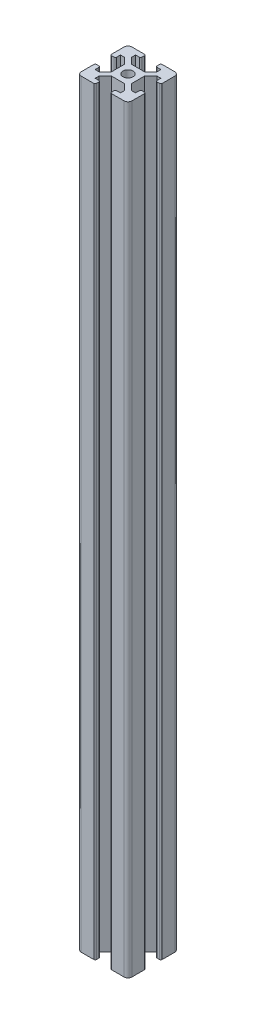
ISO-10303-21;
HEADER;
FILE_DESCRIPTION(('STEP AP214'),'2;1');
FILE_NAME('part.step','',(''),(''),'','','');
FILE_SCHEMA(('AUTOMOTIVE_DESIGN { 1 0 10303 214 1 1 1 1 }'));
ENDSEC;
DATA;
#1=APPLICATION_CONTEXT('core data for automotive mechanical design processes');
#2=APPLICATION_PROTOCOL_DEFINITION('international standard','automotive_design',2000,#1);
#3=PRODUCT_CONTEXT('',#1,'mechanical');
#4=PRODUCT('Part','Part','',(#3));
#5=PRODUCT_RELATED_PRODUCT_CATEGORY('part','',(#4));
#6=PRODUCT_DEFINITION_FORMATION('','',#4);
#7=PRODUCT_DEFINITION_CONTEXT('part definition',#1,'design');
#8=PRODUCT_DEFINITION('design','',#6,#7);
#9=PRODUCT_DEFINITION_SHAPE('','',#8);
#10=(LENGTH_UNIT() NAMED_UNIT(*) SI_UNIT(.MILLI.,.METRE.));
#11=(NAMED_UNIT(*) PLANE_ANGLE_UNIT() SI_UNIT($,.RADIAN.));
#12=(NAMED_UNIT(*) SI_UNIT($,.STERADIAN.) SOLID_ANGLE_UNIT());
#13=UNCERTAINTY_MEASURE_WITH_UNIT(LENGTH_MEASURE(1.E-05),#10,'distance_accuracy_value','');
#14=(GEOMETRIC_REPRESENTATION_CONTEXT(3) GLOBAL_UNCERTAINTY_ASSIGNED_CONTEXT((#13)) GLOBAL_UNIT_ASSIGNED_CONTEXT((#10,
#11,#12)) REPRESENTATION_CONTEXT('',''));
#15=CARTESIAN_POINT('',(0.,0.,0.));
#16=DIRECTION('',(0.,0.,1.));
#17=DIRECTION('',(1.,0.,0.));
#18=AXIS2_PLACEMENT_3D('',#15,#16,#17);
#19=CARTESIAN_POINT('',(0.,300.,0.));
#20=DIRECTION('',(0.,-1.,0.));
#21=DIRECTION('',(0.,0.,-1.));
#22=AXIS2_PLACEMENT_3D('',#19,#20,#21);
#23=PLANE('',#22);
#24=DIRECTION('',(0.,0.,1.));
#25=VECTOR('',#24,1.);
#26=CARTESIAN_POINT('',(3.,300.,10.));
#27=LINE('',#26,#25);
#28=CARTESIAN_POINT('',(3.,300.,8.5));
#29=VERTEX_POINT('',#28);
#30=CARTESIAN_POINT('',(3.,300.,9.5));
#31=VERTEX_POINT('',#30);
#32=EDGE_CURVE('E571',#29,#31,#27,.T.);
#33=ORIENTED_EDGE('',*,*,#32,.T.);
#34=CARTESIAN_POINT('',(3.5,300.,9.5));
#35=DIRECTION('',(0.,-1.,0.));
#36=DIRECTION('',(0.,0.,-1.));
#37=AXIS2_PLACEMENT_3D('',#34,#35,#36);
#38=CIRCLE('',#37,0.5);
#39=CARTESIAN_POINT('',(3.5,300.,10.));
#40=VERTEX_POINT('',#39);
#41=EDGE_CURVE('E1010',#31,#40,#38,.F.);
#42=ORIENTED_EDGE('',*,*,#41,.T.);
#43=DIRECTION('',(1.,0.,0.));
#44=VECTOR('',#43,1.);
#45=CARTESIAN_POINT('',(3.,300.,10.));
#46=LINE('',#45,#44);
#47=CARTESIAN_POINT('',(8.5,300.,10.));
#48=VERTEX_POINT('',#47);
#49=EDGE_CURVE('E574',#40,#48,#46,.T.);
#50=ORIENTED_EDGE('',*,*,#49,.T.);
#51=CARTESIAN_POINT('',(8.5,300.,8.5));
#52=DIRECTION('',(0.,-1.,0.));
#53=DIRECTION('',(0.,0.,-1.));
#54=AXIS2_PLACEMENT_3D('',#51,#52,#53);
#55=CIRCLE('',#54,1.5);
#56=CARTESIAN_POINT('',(10.,300.,8.5));
#57=VERTEX_POINT('',#56);
#58=EDGE_CURVE('E881',#48,#57,#55,.F.);
#59=ORIENTED_EDGE('',*,*,#58,.T.);
#60=DIRECTION('',(0.,0.,-1.));
#61=VECTOR('',#60,1.);
#62=CARTESIAN_POINT('',(10.,300.,10.));
#63=LINE('',#62,#61);
#64=CARTESIAN_POINT('',(10.,300.,3.5));
#65=VERTEX_POINT('',#64);
#66=EDGE_CURVE('E577',#57,#65,#63,.T.);
#67=ORIENTED_EDGE('',*,*,#66,.T.);
#68=CARTESIAN_POINT('',(9.5,300.,3.5));
#69=DIRECTION('',(0.,-1.,0.));
#70=DIRECTION('',(0.,0.,-1.));
#71=AXIS2_PLACEMENT_3D('',#68,#69,#70);
#72=CIRCLE('',#71,0.5);
#73=CARTESIAN_POINT('',(9.5,300.,3.));
#74=VERTEX_POINT('',#73);
#75=EDGE_CURVE('E993',#65,#74,#72,.F.);
#76=ORIENTED_EDGE('',*,*,#75,.T.);
#77=DIRECTION('',(-1.,0.,0.));
#78=VECTOR('',#77,1.);
#79=CARTESIAN_POINT('',(10.,300.,3.));
#80=LINE('',#79,#78);
#81=CARTESIAN_POINT('',(8.5,300.,3.));
#82=VERTEX_POINT('',#81);
#83=EDGE_CURVE('E581',#74,#82,#80,.T.);
#84=ORIENTED_EDGE('',*,*,#83,.T.);
#85=CARTESIAN_POINT('',(8.5,300.,3.5));
#86=DIRECTION('',(0.,-1.,0.));
#87=DIRECTION('',(0.,0.,-1.));
#88=AXIS2_PLACEMENT_3D('',#85,#86,#87);
#89=CIRCLE('',#88,0.5);
#90=CARTESIAN_POINT('',(8.,300.,3.5));
#91=VERTEX_POINT('',#90);
#92=EDGE_CURVE('E990',#82,#91,#89,.F.);
#93=ORIENTED_EDGE('',*,*,#92,.T.);
#94=DIRECTION('',(0.,0.,1.));
#95=VECTOR('',#94,1.);
#96=CARTESIAN_POINT('',(8.,300.,3.));
#97=LINE('',#96,#95);
#98=CARTESIAN_POINT('',(8.,300.,5.));
#99=VERTEX_POINT('',#98);
#100=EDGE_CURVE('E585',#91,#99,#97,.T.);
#101=ORIENTED_EDGE('',*,*,#100,.T.);
#102=DIRECTION('',(-1.,0.,0.));
#103=VECTOR('',#102,1.);
#104=CARTESIAN_POINT('',(8.,300.,5.));
#105=LINE('',#104,#103);
#106=CARTESIAN_POINT('',(6.41421356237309,300.,5.));
#107=VERTEX_POINT('',#106);
#108=EDGE_CURVE('E588',#99,#107,#105,.T.);
#109=ORIENTED_EDGE('',*,*,#108,.T.);
#110=DIRECTION('',(-0.707106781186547,0.,-0.707106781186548));
#111=VECTOR('',#110,1.);
#112=CARTESIAN_POINT('',(4.,300.,2.58578643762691));
#113=LINE('',#112,#111);
#114=CARTESIAN_POINT('',(4.,300.,2.58578643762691));
#115=VERTEX_POINT('',#114);
#116=EDGE_CURVE('E591',#107,#115,#113,.T.);
#117=ORIENTED_EDGE('',*,*,#116,.T.);
#118=DIRECTION('',(0.,0.,-1.));
#119=VECTOR('',#118,1.);
#120=CARTESIAN_POINT('',(4.,300.,2.58578643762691));
#121=LINE('',#120,#119);
#122=CARTESIAN_POINT('',(4.,300.,-2.58578643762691));
#123=VERTEX_POINT('',#122);
#124=EDGE_CURVE('E594',#115,#123,#121,.T.);
#125=ORIENTED_EDGE('',*,*,#124,.T.);
#126=DIRECTION('',(0.707106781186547,0.,-0.707106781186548));
#127=VECTOR('',#126,1.);
#128=CARTESIAN_POINT('',(4.,300.,-2.58578643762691));
#129=LINE('',#128,#127);
#130=CARTESIAN_POINT('',(6.41421356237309,300.,-5.));
#131=VERTEX_POINT('',#130);
#132=EDGE_CURVE('E597',#123,#131,#129,.T.);
#133=ORIENTED_EDGE('',*,*,#132,.T.);
#134=DIRECTION('',(1.,0.,0.));
#135=VECTOR('',#134,1.);
#136=CARTESIAN_POINT('',(8.,300.,-5.));
#137=LINE('',#136,#135);
#138=CARTESIAN_POINT('',(8.,300.,-5.));
#139=VERTEX_POINT('',#138);
#140=EDGE_CURVE('E600',#131,#139,#137,.T.);
#141=ORIENTED_EDGE('',*,*,#140,.T.);
#142=DIRECTION('',(0.,0.,1.));
#143=VECTOR('',#142,1.);
#144=CARTESIAN_POINT('',(8.,300.,-3.));
#145=LINE('',#144,#143);
#146=CARTESIAN_POINT('',(8.,300.,-3.5));
#147=VERTEX_POINT('',#146);
#148=EDGE_CURVE('E603',#139,#147,#145,.T.);
#149=ORIENTED_EDGE('',*,*,#148,.T.);
#150=CARTESIAN_POINT('',(8.5,300.,-3.5));
#151=DIRECTION('',(0.,-1.,0.));
#152=DIRECTION('',(0.,0.,-1.));
#153=AXIS2_PLACEMENT_3D('',#150,#151,#152);
#154=CIRCLE('',#153,0.5);
#155=CARTESIAN_POINT('',(8.5,300.,-3.));
#156=VERTEX_POINT('',#155);
#157=EDGE_CURVE('E976',#147,#156,#154,.F.);
#158=ORIENTED_EDGE('',*,*,#157,.T.);
#159=DIRECTION('',(1.,0.,0.));
#160=VECTOR('',#159,1.);
#161=CARTESIAN_POINT('',(10.,300.,-3.));
#162=LINE('',#161,#160);
#163=CARTESIAN_POINT('',(9.5,300.,-3.));
#164=VERTEX_POINT('',#163);
#165=EDGE_CURVE('E607',#156,#164,#162,.T.);
#166=ORIENTED_EDGE('',*,*,#165,.T.);
#167=CARTESIAN_POINT('',(9.5,300.,-3.5));
#168=DIRECTION('',(0.,-1.,0.));
#169=DIRECTION('',(0.,0.,-1.));
#170=AXIS2_PLACEMENT_3D('',#167,#168,#169);
#171=CIRCLE('',#170,0.5);
#172=CARTESIAN_POINT('',(10.,300.,-3.5));
#173=VERTEX_POINT('',#172);
#174=EDGE_CURVE('E973',#164,#173,#171,.F.);
#175=ORIENTED_EDGE('',*,*,#174,.T.);
#176=DIRECTION('',(0.,0.,-1.));
#177=VECTOR('',#176,1.);
#178=CARTESIAN_POINT('',(10.,300.,-10.));
#179=LINE('',#178,#177);
#180=CARTESIAN_POINT('',(10.,300.,-8.5));
#181=VERTEX_POINT('',#180);
#182=EDGE_CURVE('E759',#173,#181,#179,.T.);
#183=ORIENTED_EDGE('',*,*,#182,.T.);
#184=CARTESIAN_POINT('',(8.5,300.,-8.5));
#185=DIRECTION('',(0.,-1.,0.));
#186=DIRECTION('',(0.,0.,-1.));
#187=AXIS2_PLACEMENT_3D('',#184,#185,#186);
#188=CIRCLE('',#187,1.5);
#189=CARTESIAN_POINT('',(8.5,300.,-10.));
#190=VERTEX_POINT('',#189);
#191=EDGE_CURVE('E872',#181,#190,#188,.F.);
#192=ORIENTED_EDGE('',*,*,#191,.T.);
#193=DIRECTION('',(-1.,0.,0.));
#194=VECTOR('',#193,1.);
#195=CARTESIAN_POINT('',(3.,300.,-10.));
#196=LINE('',#195,#194);
#197=CARTESIAN_POINT('',(3.5,300.,-10.));
#198=VERTEX_POINT('',#197);
#199=EDGE_CURVE('E1111',#190,#198,#196,.T.);
#200=ORIENTED_EDGE('',*,*,#199,.T.);
#201=CARTESIAN_POINT('',(3.5,300.,-9.5));
#202=DIRECTION('',(0.,-1.,0.));
#203=DIRECTION('',(0.,0.,-1.));
#204=AXIS2_PLACEMENT_3D('',#201,#202,#203);
#205=CIRCLE('',#204,0.5);
#206=CARTESIAN_POINT('',(3.,300.,-9.5));
#207=VERTEX_POINT('',#206);
#208=EDGE_CURVE('E970',#198,#207,#205,.F.);
#209=ORIENTED_EDGE('',*,*,#208,.T.);
#210=DIRECTION('',(0.,0.,1.));
#211=VECTOR('',#210,1.);
#212=CARTESIAN_POINT('',(3.,300.,-10.));
#213=LINE('',#212,#211);
#214=CARTESIAN_POINT('',(3.,300.,-8.5));
#215=VERTEX_POINT('',#214);
#216=EDGE_CURVE('E462',#207,#215,#213,.T.);
#217=ORIENTED_EDGE('',*,*,#216,.T.);
#218=CARTESIAN_POINT('',(3.5,300.,-8.5));
#219=DIRECTION('',(0.,-1.,0.));
#220=DIRECTION('',(0.,0.,-1.));
#221=AXIS2_PLACEMENT_3D('',#218,#219,#220);
#222=CIRCLE('',#221,0.5);
#223=CARTESIAN_POINT('',(3.5,300.,-8.));
#224=VERTEX_POINT('',#223);
#225=EDGE_CURVE('E457',#215,#224,#222,.F.);
#226=ORIENTED_EDGE('',*,*,#225,.T.);
#227=DIRECTION('',(1.,0.,0.));
#228=VECTOR('',#227,1.);
#229=CARTESIAN_POINT('',(3.,300.,-8.));
#230=LINE('',#229,#228);
#231=CARTESIAN_POINT('',(5.,300.,-8.));
#232=VERTEX_POINT('',#231);
#233=EDGE_CURVE('E448',#224,#232,#230,.T.);
#234=ORIENTED_EDGE('',*,*,#233,.T.);
#235=DIRECTION('',(0.,0.,1.));
#236=VECTOR('',#235,1.);
#237=CARTESIAN_POINT('',(5.,300.,-8.));
#238=LINE('',#237,#236);
#239=CARTESIAN_POINT('',(5.,300.,-6.4142135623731));
#240=VERTEX_POINT('',#239);
#241=EDGE_CURVE('E453',#232,#240,#238,.T.);
#242=ORIENTED_EDGE('',*,*,#241,.T.);
#243=DIRECTION('',(-0.707106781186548,0.,0.707106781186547));
#244=VECTOR('',#243,1.);
#245=CARTESIAN_POINT('',(2.5857864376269,300.,-4.));
#246=LINE('',#245,#244);
#247=CARTESIAN_POINT('',(2.5857864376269,300.,-4.));
#248=VERTEX_POINT('',#247);
#249=EDGE_CURVE('E479',#240,#248,#246,.T.);
#250=ORIENTED_EDGE('',*,*,#249,.T.);
#251=DIRECTION('',(-1.,0.,0.));
#252=VECTOR('',#251,1.);
#253=CARTESIAN_POINT('',(-2.5857864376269,300.,-4.));
#254=LINE('',#253,#252);
#255=CARTESIAN_POINT('',(-2.5857864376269,300.,-4.));
#256=VERTEX_POINT('',#255);
#257=EDGE_CURVE('E483',#248,#256,#254,.T.);
#258=ORIENTED_EDGE('',*,*,#257,.T.);
#259=DIRECTION('',(-0.707106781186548,0.,-0.707106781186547));
#260=VECTOR('',#259,1.);
#261=CARTESIAN_POINT('',(-2.5857864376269,300.,-4.));
#262=LINE('',#261,#260);
#263=CARTESIAN_POINT('',(-5.,300.,-6.4142135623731));
#264=VERTEX_POINT('',#263);
#265=EDGE_CURVE('E489',#256,#264,#262,.T.);
#266=ORIENTED_EDGE('',*,*,#265,.T.);
#267=DIRECTION('',(0.,0.,-1.));
#268=VECTOR('',#267,1.);
#269=CARTESIAN_POINT('',(-5.,300.,-8.));
#270=LINE('',#269,#268);
#271=CARTESIAN_POINT('',(-5.,300.,-8.));
#272=VERTEX_POINT('',#271);
#273=EDGE_CURVE('E492',#264,#272,#270,.T.);
#274=ORIENTED_EDGE('',*,*,#273,.T.);
#275=DIRECTION('',(1.,0.,0.));
#276=VECTOR('',#275,1.);
#277=CARTESIAN_POINT('',(-3.,300.,-8.));
#278=LINE('',#277,#276);
#279=CARTESIAN_POINT('',(-3.5,300.,-8.));
#280=VERTEX_POINT('',#279);
#281=EDGE_CURVE('E495',#272,#280,#278,.T.);
#282=ORIENTED_EDGE('',*,*,#281,.T.);
#283=CARTESIAN_POINT('',(-3.5,300.,-8.5));
#284=DIRECTION('',(0.,-1.,0.));
#285=DIRECTION('',(0.,0.,-1.));
#286=AXIS2_PLACEMENT_3D('',#283,#284,#285);
#287=CIRCLE('',#286,0.5);
#288=CARTESIAN_POINT('',(-3.,300.,-8.5));
#289=VERTEX_POINT('',#288);
#290=EDGE_CURVE('E981',#280,#289,#287,.F.);
#291=ORIENTED_EDGE('',*,*,#290,.T.);
#292=DIRECTION('',(0.,0.,-1.));
#293=VECTOR('',#292,1.);
#294=CARTESIAN_POINT('',(-3.,300.,-10.));
#295=LINE('',#294,#293);
#296=CARTESIAN_POINT('',(-3.,300.,-9.5));
#297=VERTEX_POINT('',#296);
#298=EDGE_CURVE('E499',#289,#297,#295,.T.);
#299=ORIENTED_EDGE('',*,*,#298,.T.);
#300=CARTESIAN_POINT('',(-3.5,300.,-9.5));
#301=DIRECTION('',(0.,-1.,0.));
#302=DIRECTION('',(0.,0.,-1.));
#303=AXIS2_PLACEMENT_3D('',#300,#301,#302);
#304=CIRCLE('',#303,0.5);
#305=CARTESIAN_POINT('',(-3.5,300.,-10.));
#306=VERTEX_POINT('',#305);
#307=EDGE_CURVE('E967',#297,#306,#304,.F.);
#308=ORIENTED_EDGE('',*,*,#307,.T.);
#309=DIRECTION('',(-1.,0.,0.));
#310=VECTOR('',#309,1.);
#311=CARTESIAN_POINT('',(-10.,300.,-10.));
#312=LINE('',#311,#310);
#313=CARTESIAN_POINT('',(-8.5,300.,-10.));
#314=VERTEX_POINT('',#313);
#315=EDGE_CURVE('E503',#306,#314,#312,.T.);
#316=ORIENTED_EDGE('',*,*,#315,.T.);
#317=CARTESIAN_POINT('',(-8.5,300.,-8.5));
#318=DIRECTION('',(0.,-1.,0.));
#319=DIRECTION('',(0.,0.,-1.));
#320=AXIS2_PLACEMENT_3D('',#317,#318,#319);
#321=CIRCLE('',#320,1.5);
#322=CARTESIAN_POINT('',(-10.,300.,-8.5));
#323=VERTEX_POINT('',#322);
#324=EDGE_CURVE('E875',#314,#323,#321,.F.);
#325=ORIENTED_EDGE('',*,*,#324,.T.);
#326=DIRECTION('',(0.,0.,1.));
#327=VECTOR('',#326,1.);
#328=CARTESIAN_POINT('',(-10.,300.,-10.));
#329=LINE('',#328,#327);
#330=CARTESIAN_POINT('',(-10.,300.,-3.5));
#331=VERTEX_POINT('',#330);
#332=EDGE_CURVE('E506',#323,#331,#329,.T.);
#333=ORIENTED_EDGE('',*,*,#332,.T.);
#334=CARTESIAN_POINT('',(-9.5,300.,-3.5));
#335=DIRECTION('',(0.,-1.,0.));
#336=DIRECTION('',(0.,0.,-1.));
#337=AXIS2_PLACEMENT_3D('',#334,#335,#336);
#338=CIRCLE('',#337,0.5);
#339=CARTESIAN_POINT('',(-9.5,300.,-3.));
#340=VERTEX_POINT('',#339);
#341=EDGE_CURVE('E987',#331,#340,#338,.F.);
#342=ORIENTED_EDGE('',*,*,#341,.T.);
#343=DIRECTION('',(1.,0.,0.));
#344=VECTOR('',#343,1.);
#345=CARTESIAN_POINT('',(-10.,300.,-3.));
#346=LINE('',#345,#344);
#347=CARTESIAN_POINT('',(-8.5,300.,-3.));
#348=VERTEX_POINT('',#347);
#349=EDGE_CURVE('E510',#340,#348,#346,.T.);
#350=ORIENTED_EDGE('',*,*,#349,.T.);
#351=CARTESIAN_POINT('',(-8.5,300.,-3.5));
#352=DIRECTION('',(0.,-1.,0.));
#353=DIRECTION('',(0.,0.,-1.));
#354=AXIS2_PLACEMENT_3D('',#351,#352,#353);
#355=CIRCLE('',#354,0.5);
#356=CARTESIAN_POINT('',(-8.,300.,-3.5));
#357=VERTEX_POINT('',#356);
#358=EDGE_CURVE('E984',#348,#357,#355,.F.);
#359=ORIENTED_EDGE('',*,*,#358,.T.);
#360=DIRECTION('',(0.,0.,-1.));
#361=VECTOR('',#360,1.);
#362=CARTESIAN_POINT('',(-8.,300.,-3.));
#363=LINE('',#362,#361);
#364=CARTESIAN_POINT('',(-8.,300.,-5.));
#365=VERTEX_POINT('',#364);
#366=EDGE_CURVE('E514',#357,#365,#363,.T.);
#367=ORIENTED_EDGE('',*,*,#366,.T.);
#368=DIRECTION('',(1.,0.,0.));
#369=VECTOR('',#368,1.);
#370=CARTESIAN_POINT('',(-8.,300.,-5.));
#371=LINE('',#370,#369);
#372=CARTESIAN_POINT('',(-6.41421356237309,300.,-5.));
#373=VERTEX_POINT('',#372);
#374=EDGE_CURVE('E517',#365,#373,#371,.T.);
#375=ORIENTED_EDGE('',*,*,#374,.T.);
#376=DIRECTION('',(0.707106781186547,0.,0.707106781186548));
#377=VECTOR('',#376,1.);
#378=CARTESIAN_POINT('',(-4.,300.,-2.58578643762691));
#379=LINE('',#378,#377);
#380=CARTESIAN_POINT('',(-4.,300.,-2.58578643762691));
#381=VERTEX_POINT('',#380);
#382=EDGE_CURVE('E520',#373,#381,#379,.T.);
#383=ORIENTED_EDGE('',*,*,#382,.T.);
#384=DIRECTION('',(0.,0.,1.));
#385=VECTOR('',#384,1.);
#386=CARTESIAN_POINT('',(-4.,300.,2.58578643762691));
#387=LINE('',#386,#385);
#388=CARTESIAN_POINT('',(-4.,300.,2.58578643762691));
#389=VERTEX_POINT('',#388);
#390=EDGE_CURVE('E523',#381,#389,#387,.T.);
#391=ORIENTED_EDGE('',*,*,#390,.T.);
#392=DIRECTION('',(-0.707106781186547,0.,0.707106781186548));
#393=VECTOR('',#392,1.);
#394=CARTESIAN_POINT('',(-4.,300.,2.58578643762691));
#395=LINE('',#394,#393);
#396=CARTESIAN_POINT('',(-6.41421356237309,300.,5.));
#397=VERTEX_POINT('',#396);
#398=EDGE_CURVE('E526',#389,#397,#395,.T.);
#399=ORIENTED_EDGE('',*,*,#398,.T.);
#400=DIRECTION('',(-1.,0.,0.));
#401=VECTOR('',#400,1.);
#402=CARTESIAN_POINT('',(-8.,300.,5.));
#403=LINE('',#402,#401);
#404=CARTESIAN_POINT('',(-8.,300.,5.));
#405=VERTEX_POINT('',#404);
#406=EDGE_CURVE('E529',#397,#405,#403,.T.);
#407=ORIENTED_EDGE('',*,*,#406,.T.);
#408=DIRECTION('',(0.,0.,-1.));
#409=VECTOR('',#408,1.);
#410=CARTESIAN_POINT('',(-8.,300.,3.));
#411=LINE('',#410,#409);
#412=CARTESIAN_POINT('',(-8.,300.,3.5));
#413=VERTEX_POINT('',#412);
#414=EDGE_CURVE('E532',#405,#413,#411,.T.);
#415=ORIENTED_EDGE('',*,*,#414,.T.);
#416=CARTESIAN_POINT('',(-8.5,300.,3.5));
#417=DIRECTION('',(0.,-1.,0.));
#418=DIRECTION('',(0.,0.,-1.));
#419=AXIS2_PLACEMENT_3D('',#416,#417,#418);
#420=CIRCLE('',#419,0.5);
#421=CARTESIAN_POINT('',(-8.5,300.,3.));
#422=VERTEX_POINT('',#421);
#423=EDGE_CURVE('E996',#413,#422,#420,.F.);
#424=ORIENTED_EDGE('',*,*,#423,.T.);
#425=DIRECTION('',(-1.,0.,0.));
#426=VECTOR('',#425,1.);
#427=CARTESIAN_POINT('',(-10.,300.,3.));
#428=LINE('',#427,#426);
#429=CARTESIAN_POINT('',(-9.5,300.,3.));
#430=VERTEX_POINT('',#429);
#431=EDGE_CURVE('E536',#422,#430,#428,.T.);
#432=ORIENTED_EDGE('',*,*,#431,.T.);
#433=CARTESIAN_POINT('',(-9.5,300.,3.5));
#434=DIRECTION('',(0.,-1.,0.));
#435=DIRECTION('',(0.,0.,-1.));
#436=AXIS2_PLACEMENT_3D('',#433,#434,#435);
#437=CIRCLE('',#436,0.5);
#438=CARTESIAN_POINT('',(-10.,300.,3.5));
#439=VERTEX_POINT('',#438);
#440=EDGE_CURVE('E999',#430,#439,#437,.F.);
#441=ORIENTED_EDGE('',*,*,#440,.T.);
#442=DIRECTION('',(0.,0.,1.));
#443=VECTOR('',#442,1.);
#444=CARTESIAN_POINT('',(-10.,300.,3.));
#445=LINE('',#444,#443);
#446=CARTESIAN_POINT('',(-10.,300.,8.5));
#447=VERTEX_POINT('',#446);
#448=EDGE_CURVE('E540',#439,#447,#445,.T.);
#449=ORIENTED_EDGE('',*,*,#448,.T.);
#450=CARTESIAN_POINT('',(-8.5,300.,8.5));
#451=DIRECTION('',(0.,-1.,0.));
#452=DIRECTION('',(0.,0.,-1.));
#453=AXIS2_PLACEMENT_3D('',#450,#451,#452);
#454=CIRCLE('',#453,1.5);
#455=CARTESIAN_POINT('',(-8.5,300.,10.));
#456=VERTEX_POINT('',#455);
#457=EDGE_CURVE('E878',#447,#456,#454,.F.);
#458=ORIENTED_EDGE('',*,*,#457,.T.);
#459=DIRECTION('',(1.,0.,0.));
#460=VECTOR('',#459,1.);
#461=CARTESIAN_POINT('',(-10.,300.,10.));
#462=LINE('',#461,#460);
#463=CARTESIAN_POINT('',(-3.5,300.,10.));
#464=VERTEX_POINT('',#463);
#465=EDGE_CURVE('E543',#456,#464,#462,.T.);
#466=ORIENTED_EDGE('',*,*,#465,.T.);
#467=CARTESIAN_POINT('',(-3.5,300.,9.5));
#468=DIRECTION('',(0.,-1.,0.));
#469=DIRECTION('',(0.,0.,-1.));
#470=AXIS2_PLACEMENT_3D('',#467,#468,#469);
#471=CIRCLE('',#470,0.5);
#472=CARTESIAN_POINT('',(-3.,300.,9.5));
#473=VERTEX_POINT('',#472);
#474=EDGE_CURVE('E1004',#464,#473,#471,.F.);
#475=ORIENTED_EDGE('',*,*,#474,.T.);
#476=DIRECTION('',(0.,0.,-1.));
#477=VECTOR('',#476,1.);
#478=CARTESIAN_POINT('',(-3.,300.,10.));
#479=LINE('',#478,#477);
#480=CARTESIAN_POINT('',(-3.,300.,8.5));
#481=VERTEX_POINT('',#480);
#482=EDGE_CURVE('E547',#473,#481,#479,.T.);
#483=ORIENTED_EDGE('',*,*,#482,.T.);
#484=CARTESIAN_POINT('',(-3.5,300.,8.5));
#485=DIRECTION('',(0.,-1.,0.));
#486=DIRECTION('',(0.,0.,-1.));
#487=AXIS2_PLACEMENT_3D('',#484,#485,#486);
#488=CIRCLE('',#487,0.5);
#489=CARTESIAN_POINT('',(-3.5,300.,8.));
#490=VERTEX_POINT('',#489);
#491=EDGE_CURVE('E69',#481,#490,#488,.F.);
#492=ORIENTED_EDGE('',*,*,#491,.T.);
#493=DIRECTION('',(-1.,0.,0.));
#494=VECTOR('',#493,1.);
#495=CARTESIAN_POINT('',(-3.,300.,8.));
#496=LINE('',#495,#494);
#497=CARTESIAN_POINT('',(-5.,300.,8.));
#498=VERTEX_POINT('',#497);
#499=EDGE_CURVE('E550',#490,#498,#496,.T.);
#500=ORIENTED_EDGE('',*,*,#499,.T.);
#501=DIRECTION('',(0.,0.,-1.));
#502=VECTOR('',#501,1.);
#503=CARTESIAN_POINT('',(-5.,300.,8.));
#504=LINE('',#503,#502);
#505=CARTESIAN_POINT('',(-5.,300.,6.4142135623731));
#506=VERTEX_POINT('',#505);
#507=EDGE_CURVE('E553',#498,#506,#504,.T.);
#508=ORIENTED_EDGE('',*,*,#507,.T.);
#509=DIRECTION('',(0.707106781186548,0.,-0.707106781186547));
#510=VECTOR('',#509,1.);
#511=CARTESIAN_POINT('',(-2.5857864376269,300.,4.));
#512=LINE('',#511,#510);
#513=CARTESIAN_POINT('',(-2.5857864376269,300.,4.));
#514=VERTEX_POINT('',#513);
#515=EDGE_CURVE('E556',#506,#514,#512,.T.);
#516=ORIENTED_EDGE('',*,*,#515,.T.);
#517=DIRECTION('',(1.,0.,0.));
#518=VECTOR('',#517,1.);
#519=CARTESIAN_POINT('',(-2.5857864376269,300.,4.));
#520=LINE('',#519,#518);
#521=CARTESIAN_POINT('',(2.5857864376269,300.,4.));
#522=VERTEX_POINT('',#521);
#523=EDGE_CURVE('E559',#514,#522,#520,.T.);
#524=ORIENTED_EDGE('',*,*,#523,.T.);
#525=DIRECTION('',(0.707106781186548,0.,0.707106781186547));
#526=VECTOR('',#525,1.);
#527=CARTESIAN_POINT('',(2.5857864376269,300.,4.));
#528=LINE('',#527,#526);
#529=CARTESIAN_POINT('',(5.,300.,6.4142135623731));
#530=VERTEX_POINT('',#529);
#531=EDGE_CURVE('E562',#522,#530,#528,.T.);
#532=ORIENTED_EDGE('',*,*,#531,.T.);
#533=DIRECTION('',(0.,0.,1.));
#534=VECTOR('',#533,1.);
#535=CARTESIAN_POINT('',(5.,300.,8.));
#536=LINE('',#535,#534);
#537=CARTESIAN_POINT('',(5.,300.,8.));
#538=VERTEX_POINT('',#537);
#539=EDGE_CURVE('E565',#530,#538,#536,.T.);
#540=ORIENTED_EDGE('',*,*,#539,.T.);
#541=DIRECTION('',(-1.,0.,0.));
#542=VECTOR('',#541,1.);
#543=CARTESIAN_POINT('',(3.,300.,8.));
#544=LINE('',#543,#542);
#545=CARTESIAN_POINT('',(3.5,300.,8.));
#546=VERTEX_POINT('',#545);
#547=EDGE_CURVE('E568',#538,#546,#544,.T.);
#548=ORIENTED_EDGE('',*,*,#547,.T.);
#549=CARTESIAN_POINT('',(3.5,300.,8.5));
#550=DIRECTION('',(0.,-1.,0.));
#551=DIRECTION('',(0.,0.,-1.));
#552=AXIS2_PLACEMENT_3D('',#549,#550,#551);
#553=CIRCLE('',#552,0.5);
#554=EDGE_CURVE('E1007',#546,#29,#553,.F.);
#555=ORIENTED_EDGE('',*,*,#554,.T.);
#556=EDGE_LOOP('',(#33,#42,#50,#59,#67,#76,#84,#93,#101,#109,#117,#125,#133,#141,#149,#158,#166,
#175,#183,#192,#200,#209,#217,#226,#234,#242,#250,#258,#266,#274,#282,#291,#299,#308,#316,#325,
#333,#342,#350,#359,#367,#375,#383,#391,#399,#407,#415,#424,#432,#441,#449,#458,#466,#475,#483,
#492,#500,#508,#516,#524,#532,#540,#548,#555));
#557=FACE_BOUND('',#556,.T.);
#558=CARTESIAN_POINT('',(0.,300.,0.));
#559=DIRECTION('',(0.,1.,0.));
#560=DIRECTION('',(0.,0.,1.));
#561=AXIS2_PLACEMENT_3D('',#558,#559,#560);
#562=CIRCLE('',#561,2.);
#563=CARTESIAN_POINT('',(0.,300.,2.));
#564=VERTEX_POINT('',#563);
#565=EDGE_CURVE('E616',#564,#564,#562,.T.);
#566=ORIENTED_EDGE('',*,*,#565,.F.);
#567=EDGE_LOOP('',(#566));
#568=FACE_BOUND('',#567,.T.);
#569=ADVANCED_FACE('F45',(#557,#568),#23,.F.);
#570=CARTESIAN_POINT('',(0.,0.,0.));
#571=DIRECTION('',(0.,-1.,0.));
#572=DIRECTION('',(0.,0.,-1.));
#573=AXIS2_PLACEMENT_3D('',#570,#571,#572);
#574=PLANE('',#573);
#575=DIRECTION('',(1.,0.,0.));
#576=VECTOR('',#575,1.);
#577=CARTESIAN_POINT('',(3.,0.,10.));
#578=LINE('',#577,#576);
#579=CARTESIAN_POINT('',(3.5,0.,10.));
#580=VERTEX_POINT('',#579);
#581=CARTESIAN_POINT('',(8.5,0.,10.));
#582=VERTEX_POINT('',#581);
#583=EDGE_CURVE('E722',#580,#582,#578,.T.);
#584=ORIENTED_EDGE('',*,*,#583,.F.);
#585=CARTESIAN_POINT('',(3.5,0.,9.5));
#586=DIRECTION('',(0.,-1.,0.));
#587=DIRECTION('',(0.,0.,-1.));
#588=AXIS2_PLACEMENT_3D('',#585,#586,#587);
#589=CIRCLE('',#588,0.5);
#590=CARTESIAN_POINT('',(3.,0.,9.5));
#591=VERTEX_POINT('',#590);
#592=EDGE_CURVE('E957',#580,#591,#589,.T.);
#593=ORIENTED_EDGE('',*,*,#592,.T.);
#594=DIRECTION('',(0.,0.,1.));
#595=VECTOR('',#594,1.);
#596=CARTESIAN_POINT('',(3.,0.,10.));
#597=LINE('',#596,#595);
#598=CARTESIAN_POINT('',(3.,0.,8.5));
#599=VERTEX_POINT('',#598);
#600=EDGE_CURVE('E718',#599,#591,#597,.T.);
#601=ORIENTED_EDGE('',*,*,#600,.F.);
#602=CARTESIAN_POINT('',(3.5,0.,8.5));
#603=DIRECTION('',(0.,-1.,0.));
#604=DIRECTION('',(0.,0.,-1.));
#605=AXIS2_PLACEMENT_3D('',#602,#603,#604);
#606=CIRCLE('',#605,0.5);
#607=CARTESIAN_POINT('',(3.5,0.,8.));
#608=VERTEX_POINT('',#607);
#609=EDGE_CURVE('E954',#599,#608,#606,.T.);
#610=ORIENTED_EDGE('',*,*,#609,.T.);
#611=DIRECTION('',(-1.,0.,0.));
#612=VECTOR('',#611,1.);
#613=CARTESIAN_POINT('',(3.,0.,8.));
#614=LINE('',#613,#612);
#615=CARTESIAN_POINT('',(5.,0.,8.));
#616=VERTEX_POINT('',#615);
#617=EDGE_CURVE('E715',#616,#608,#614,.T.);
#618=ORIENTED_EDGE('',*,*,#617,.F.);
#619=DIRECTION('',(0.,0.,1.));
#620=VECTOR('',#619,1.);
#621=CARTESIAN_POINT('',(5.,0.,8.));
#622=LINE('',#621,#620);
#623=CARTESIAN_POINT('',(5.,0.,6.4142135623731));
#624=VERTEX_POINT('',#623);
#625=EDGE_CURVE('E712',#624,#616,#622,.T.);
#626=ORIENTED_EDGE('',*,*,#625,.F.);
#627=DIRECTION('',(0.707106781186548,0.,0.707106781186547));
#628=VECTOR('',#627,1.);
#629=CARTESIAN_POINT('',(2.5857864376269,0.,4.));
#630=LINE('',#629,#628);
#631=CARTESIAN_POINT('',(2.5857864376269,0.,4.));
#632=VERTEX_POINT('',#631);
#633=EDGE_CURVE('E709',#632,#624,#630,.T.);
#634=ORIENTED_EDGE('',*,*,#633,.F.);
#635=DIRECTION('',(1.,0.,0.));
#636=VECTOR('',#635,1.);
#637=CARTESIAN_POINT('',(-2.5857864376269,0.,4.));
#638=LINE('',#637,#636);
#639=CARTESIAN_POINT('',(-2.5857864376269,0.,4.));
#640=VERTEX_POINT('',#639);
#641=EDGE_CURVE('E706',#640,#632,#638,.T.);
#642=ORIENTED_EDGE('',*,*,#641,.F.);
#643=DIRECTION('',(0.707106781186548,0.,-0.707106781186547));
#644=VECTOR('',#643,1.);
#645=CARTESIAN_POINT('',(-2.5857864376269,0.,4.));
#646=LINE('',#645,#644);
#647=CARTESIAN_POINT('',(-5.,0.,6.4142135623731));
#648=VERTEX_POINT('',#647);
#649=EDGE_CURVE('E703',#648,#640,#646,.T.);
#650=ORIENTED_EDGE('',*,*,#649,.F.);
#651=DIRECTION('',(0.,0.,-1.));
#652=VECTOR('',#651,1.);
#653=CARTESIAN_POINT('',(-5.,0.,8.));
#654=LINE('',#653,#652);
#655=CARTESIAN_POINT('',(-5.,0.,8.));
#656=VERTEX_POINT('',#655);
#657=EDGE_CURVE('E700',#656,#648,#654,.T.);
#658=ORIENTED_EDGE('',*,*,#657,.F.);
#659=DIRECTION('',(-1.,0.,0.));
#660=VECTOR('',#659,1.);
#661=CARTESIAN_POINT('',(-3.,0.,8.));
#662=LINE('',#661,#660);
#663=CARTESIAN_POINT('',(-3.5,0.,8.));
#664=VERTEX_POINT('',#663);
#665=EDGE_CURVE('E697',#664,#656,#662,.T.);
#666=ORIENTED_EDGE('',*,*,#665,.F.);
#667=CARTESIAN_POINT('',(-3.5,0.,8.5));
#668=DIRECTION('',(0.,-1.,0.));
#669=DIRECTION('',(0.,0.,-1.));
#670=AXIS2_PLACEMENT_3D('',#667,#668,#669);
#671=CIRCLE('',#670,0.5);
#672=CARTESIAN_POINT('',(-3.,0.,8.5));
#673=VERTEX_POINT('',#672);
#674=EDGE_CURVE('E948',#664,#673,#671,.T.);
#675=ORIENTED_EDGE('',*,*,#674,.T.);
#676=DIRECTION('',(0.,0.,-1.));
#677=VECTOR('',#676,1.);
#678=CARTESIAN_POINT('',(-3.,0.,10.));
#679=LINE('',#678,#677);
#680=CARTESIAN_POINT('',(-3.,0.,9.5));
#681=VERTEX_POINT('',#680);
#682=EDGE_CURVE('E693',#681,#673,#679,.T.);
#683=ORIENTED_EDGE('',*,*,#682,.F.);
#684=CARTESIAN_POINT('',(-3.5,0.,9.5));
#685=DIRECTION('',(0.,-1.,0.));
#686=DIRECTION('',(0.,0.,-1.));
#687=AXIS2_PLACEMENT_3D('',#684,#685,#686);
#688=CIRCLE('',#687,0.5);
#689=CARTESIAN_POINT('',(-3.5,0.,10.));
#690=VERTEX_POINT('',#689);
#691=EDGE_CURVE('E951',#681,#690,#688,.T.);
#692=ORIENTED_EDGE('',*,*,#691,.T.);
#693=DIRECTION('',(1.,0.,0.));
#694=VECTOR('',#693,1.);
#695=CARTESIAN_POINT('',(-10.,0.,10.));
#696=LINE('',#695,#694);
#697=CARTESIAN_POINT('',(-8.5,0.,10.));
#698=VERTEX_POINT('',#697);
#699=EDGE_CURVE('E689',#698,#690,#696,.T.);
#700=ORIENTED_EDGE('',*,*,#699,.F.);
#701=CARTESIAN_POINT('',(-8.5,0.,8.5));
#702=DIRECTION('',(0.,-1.,0.));
#703=DIRECTION('',(0.,0.,-1.));
#704=AXIS2_PLACEMENT_3D('',#701,#702,#703);
#705=CIRCLE('',#704,1.5);
#706=CARTESIAN_POINT('',(-10.,0.,8.5));
#707=VERTEX_POINT('',#706);
#708=EDGE_CURVE('E860',#698,#707,#705,.T.);
#709=ORIENTED_EDGE('',*,*,#708,.T.);
#710=DIRECTION('',(0.,0.,1.));
#711=VECTOR('',#710,1.);
#712=CARTESIAN_POINT('',(-10.,0.,3.));
#713=LINE('',#712,#711);
#714=CARTESIAN_POINT('',(-10.,0.,3.5));
#715=VERTEX_POINT('',#714);
#716=EDGE_CURVE('E686',#715,#707,#713,.T.);
#717=ORIENTED_EDGE('',*,*,#716,.F.);
#718=CARTESIAN_POINT('',(-9.5,0.,3.5));
#719=DIRECTION('',(0.,-1.,0.));
#720=DIRECTION('',(0.,0.,-1.));
#721=AXIS2_PLACEMENT_3D('',#718,#719,#720);
#722=CIRCLE('',#721,0.5);
#723=CARTESIAN_POINT('',(-9.5,0.,3.));
#724=VERTEX_POINT('',#723);
#725=EDGE_CURVE('E945',#715,#724,#722,.T.);
#726=ORIENTED_EDGE('',*,*,#725,.T.);
#727=DIRECTION('',(-1.,0.,0.));
#728=VECTOR('',#727,1.);
#729=CARTESIAN_POINT('',(-10.,0.,3.));
#730=LINE('',#729,#728);
#731=CARTESIAN_POINT('',(-8.5,0.,3.));
#732=VERTEX_POINT('',#731);
#733=EDGE_CURVE('E682',#732,#724,#730,.T.);
#734=ORIENTED_EDGE('',*,*,#733,.F.);
#735=CARTESIAN_POINT('',(-8.5,0.,3.5));
#736=DIRECTION('',(0.,-1.,0.));
#737=DIRECTION('',(0.,0.,-1.));
#738=AXIS2_PLACEMENT_3D('',#735,#736,#737);
#739=CIRCLE('',#738,0.5);
#740=CARTESIAN_POINT('',(-8.,0.,3.5));
#741=VERTEX_POINT('',#740);
#742=EDGE_CURVE('E942',#732,#741,#739,.T.);
#743=ORIENTED_EDGE('',*,*,#742,.T.);
#744=DIRECTION('',(0.,0.,-1.));
#745=VECTOR('',#744,1.);
#746=CARTESIAN_POINT('',(-8.,0.,3.));
#747=LINE('',#746,#745);
#748=CARTESIAN_POINT('',(-8.,0.,5.));
#749=VERTEX_POINT('',#748);
#750=EDGE_CURVE('E678',#749,#741,#747,.T.);
#751=ORIENTED_EDGE('',*,*,#750,.F.);
#752=DIRECTION('',(-1.,0.,0.));
#753=VECTOR('',#752,1.);
#754=CARTESIAN_POINT('',(-8.,0.,5.));
#755=LINE('',#754,#753);
#756=CARTESIAN_POINT('',(-6.41421356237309,0.,5.));
#757=VERTEX_POINT('',#756);
#758=EDGE_CURVE('E675',#757,#749,#755,.T.);
#759=ORIENTED_EDGE('',*,*,#758,.F.);
#760=DIRECTION('',(-0.707106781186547,0.,0.707106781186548));
#761=VECTOR('',#760,1.);
#762=CARTESIAN_POINT('',(-4.,0.,2.58578643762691));
#763=LINE('',#762,#761);
#764=CARTESIAN_POINT('',(-4.,0.,2.58578643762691));
#765=VERTEX_POINT('',#764);
#766=EDGE_CURVE('E672',#765,#757,#763,.T.);
#767=ORIENTED_EDGE('',*,*,#766,.F.);
#768=DIRECTION('',(0.,0.,1.));
#769=VECTOR('',#768,1.);
#770=CARTESIAN_POINT('',(-4.,0.,2.58578643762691));
#771=LINE('',#770,#769);
#772=CARTESIAN_POINT('',(-4.,0.,-2.58578643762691));
#773=VERTEX_POINT('',#772);
#774=EDGE_CURVE('E669',#773,#765,#771,.T.);
#775=ORIENTED_EDGE('',*,*,#774,.F.);
#776=DIRECTION('',(0.707106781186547,0.,0.707106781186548));
#777=VECTOR('',#776,1.);
#778=CARTESIAN_POINT('',(-4.,0.,-2.58578643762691));
#779=LINE('',#778,#777);
#780=CARTESIAN_POINT('',(-6.41421356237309,0.,-5.));
#781=VERTEX_POINT('',#780);
#782=EDGE_CURVE('E666',#781,#773,#779,.T.);
#783=ORIENTED_EDGE('',*,*,#782,.F.);
#784=DIRECTION('',(1.,0.,0.));
#785=VECTOR('',#784,1.);
#786=CARTESIAN_POINT('',(-8.,0.,-5.));
#787=LINE('',#786,#785);
#788=CARTESIAN_POINT('',(-8.,0.,-5.));
#789=VERTEX_POINT('',#788);
#790=EDGE_CURVE('E663',#789,#781,#787,.T.);
#791=ORIENTED_EDGE('',*,*,#790,.F.);
#792=DIRECTION('',(0.,0.,-1.));
#793=VECTOR('',#792,1.);
#794=CARTESIAN_POINT('',(-8.,0.,-3.));
#795=LINE('',#794,#793);
#796=CARTESIAN_POINT('',(-8.,0.,-3.5));
#797=VERTEX_POINT('',#796);
#798=EDGE_CURVE('E660',#797,#789,#795,.T.);
#799=ORIENTED_EDGE('',*,*,#798,.F.);
#800=CARTESIAN_POINT('',(-8.5,0.,-3.5));
#801=DIRECTION('',(0.,-1.,0.));
#802=DIRECTION('',(0.,0.,-1.));
#803=AXIS2_PLACEMENT_3D('',#800,#801,#802);
#804=CIRCLE('',#803,0.5);
#805=CARTESIAN_POINT('',(-8.5,0.,-3.));
#806=VERTEX_POINT('',#805);
#807=EDGE_CURVE('E930',#797,#806,#804,.T.);
#808=ORIENTED_EDGE('',*,*,#807,.T.);
#809=DIRECTION('',(1.,0.,0.));
#810=VECTOR('',#809,1.);
#811=CARTESIAN_POINT('',(-10.,0.,-3.));
#812=LINE('',#811,#810);
#813=CARTESIAN_POINT('',(-9.5,0.,-3.));
#814=VERTEX_POINT('',#813);
#815=EDGE_CURVE('E656',#814,#806,#812,.T.);
#816=ORIENTED_EDGE('',*,*,#815,.F.);
#817=CARTESIAN_POINT('',(-9.5,0.,-3.5));
#818=DIRECTION('',(0.,-1.,0.));
#819=DIRECTION('',(0.,0.,-1.));
#820=AXIS2_PLACEMENT_3D('',#817,#818,#819);
#821=CIRCLE('',#820,0.5);
#822=CARTESIAN_POINT('',(-10.,0.,-3.5));
#823=VERTEX_POINT('',#822);
#824=EDGE_CURVE('E933',#814,#823,#821,.T.);
#825=ORIENTED_EDGE('',*,*,#824,.T.);
#826=DIRECTION('',(0.,0.,1.));
#827=VECTOR('',#826,1.);
#828=CARTESIAN_POINT('',(-10.,0.,-10.));
#829=LINE('',#828,#827);
#830=CARTESIAN_POINT('',(-10.,0.,-8.5));
#831=VERTEX_POINT('',#830);
#832=EDGE_CURVE('E652',#831,#823,#829,.T.);
#833=ORIENTED_EDGE('',*,*,#832,.F.);
#834=CARTESIAN_POINT('',(-8.5,0.,-8.5));
#835=DIRECTION('',(0.,-1.,0.));
#836=DIRECTION('',(0.,0.,-1.));
#837=AXIS2_PLACEMENT_3D('',#834,#835,#836);
#838=CIRCLE('',#837,1.5);
#839=CARTESIAN_POINT('',(-8.5,0.,-10.));
#840=VERTEX_POINT('',#839);
#841=EDGE_CURVE('E856',#831,#840,#838,.T.);
#842=ORIENTED_EDGE('',*,*,#841,.T.);
#843=DIRECTION('',(-1.,0.,0.));
#844=VECTOR('',#843,1.);
#845=CARTESIAN_POINT('',(-10.,0.,-10.));
#846=LINE('',#845,#844);
#847=CARTESIAN_POINT('',(-3.5,0.,-10.));
#848=VERTEX_POINT('',#847);
#849=EDGE_CURVE('E649',#848,#840,#846,.T.);
#850=ORIENTED_EDGE('',*,*,#849,.F.);
#851=CARTESIAN_POINT('',(-3.5,0.,-9.5));
#852=DIRECTION('',(0.,-1.,0.));
#853=DIRECTION('',(0.,0.,-1.));
#854=AXIS2_PLACEMENT_3D('',#851,#852,#853);
#855=CIRCLE('',#854,0.5);
#856=CARTESIAN_POINT('',(-3.,0.,-9.5));
#857=VERTEX_POINT('',#856);
#858=EDGE_CURVE('E912',#848,#857,#855,.T.);
#859=ORIENTED_EDGE('',*,*,#858,.T.);
#860=DIRECTION('',(0.,0.,-1.));
#861=VECTOR('',#860,1.);
#862=CARTESIAN_POINT('',(-3.,0.,-10.));
#863=LINE('',#862,#861);
#864=CARTESIAN_POINT('',(-3.,0.,-8.5));
#865=VERTEX_POINT('',#864);
#866=EDGE_CURVE('E645',#865,#857,#863,.T.);
#867=ORIENTED_EDGE('',*,*,#866,.F.);
#868=CARTESIAN_POINT('',(-3.5,0.,-8.5));
#869=DIRECTION('',(0.,-1.,0.));
#870=DIRECTION('',(0.,0.,-1.));
#871=AXIS2_PLACEMENT_3D('',#868,#869,#870);
#872=CIRCLE('',#871,0.5);
#873=CARTESIAN_POINT('',(-3.5,0.,-8.));
#874=VERTEX_POINT('',#873);
#875=EDGE_CURVE('E927',#865,#874,#872,.T.);
#876=ORIENTED_EDGE('',*,*,#875,.T.);
#877=DIRECTION('',(1.,0.,0.));
#878=VECTOR('',#877,1.);
#879=CARTESIAN_POINT('',(-3.,0.,-8.));
#880=LINE('',#879,#878);
#881=CARTESIAN_POINT('',(-5.,0.,-8.));
#882=VERTEX_POINT('',#881);
#883=EDGE_CURVE('E641',#882,#874,#880,.T.);
#884=ORIENTED_EDGE('',*,*,#883,.F.);
#885=DIRECTION('',(0.,0.,-1.));
#886=VECTOR('',#885,1.);
#887=CARTESIAN_POINT('',(-5.,0.,-8.));
#888=LINE('',#887,#886);
#889=CARTESIAN_POINT('',(-5.,0.,-6.4142135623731));
#890=VERTEX_POINT('',#889);
#891=EDGE_CURVE('E638',#890,#882,#888,.T.);
#892=ORIENTED_EDGE('',*,*,#891,.F.);
#893=DIRECTION('',(-0.707106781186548,0.,-0.707106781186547));
#894=VECTOR('',#893,1.);
#895=CARTESIAN_POINT('',(-2.5857864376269,0.,-4.));
#896=LINE('',#895,#894);
#897=CARTESIAN_POINT('',(-2.5857864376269,0.,-4.));
#898=VERTEX_POINT('',#897);
#899=EDGE_CURVE('E635',#898,#890,#896,.T.);
#900=ORIENTED_EDGE('',*,*,#899,.F.);
#901=DIRECTION('',(-1.,0.,0.));
#902=VECTOR('',#901,1.);
#903=CARTESIAN_POINT('',(-2.5857864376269,0.,-4.));
#904=LINE('',#903,#902);
#905=CARTESIAN_POINT('',(2.5857864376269,0.,-4.));
#906=VERTEX_POINT('',#905);
#907=EDGE_CURVE('E632',#906,#898,#904,.T.);
#908=ORIENTED_EDGE('',*,*,#907,.F.);
#909=DIRECTION('',(-0.707106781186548,0.,0.707106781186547));
#910=VECTOR('',#909,1.);
#911=CARTESIAN_POINT('',(2.5857864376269,0.,-4.));
#912=LINE('',#911,#910);
#913=CARTESIAN_POINT('',(5.,0.,-6.4142135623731));
#914=VERTEX_POINT('',#913);
#915=EDGE_CURVE('E629',#914,#906,#912,.T.);
#916=ORIENTED_EDGE('',*,*,#915,.F.);
#917=DIRECTION('',(0.,0.,1.));
#918=VECTOR('',#917,1.);
#919=CARTESIAN_POINT('',(5.,0.,-8.));
#920=LINE('',#919,#918);
#921=CARTESIAN_POINT('',(5.,0.,-8.));
#922=VERTEX_POINT('',#921);
#923=EDGE_CURVE('E626',#922,#914,#920,.T.);
#924=ORIENTED_EDGE('',*,*,#923,.F.);
#925=DIRECTION('',(1.,0.,0.));
#926=VECTOR('',#925,1.);
#927=CARTESIAN_POINT('',(3.,0.,-8.));
#928=LINE('',#927,#926);
#929=CARTESIAN_POINT('',(3.5,0.,-8.));
#930=VERTEX_POINT('',#929);
#931=EDGE_CURVE('E468',#930,#922,#928,.T.);
#932=ORIENTED_EDGE('',*,*,#931,.F.);
#933=CARTESIAN_POINT('',(3.5,0.,-8.5));
#934=DIRECTION('',(0.,-1.,0.));
#935=DIRECTION('',(0.,0.,-1.));
#936=AXIS2_PLACEMENT_3D('',#933,#934,#935);
#937=CIRCLE('',#936,0.5);
#938=CARTESIAN_POINT('',(3.,0.,-8.5));
#939=VERTEX_POINT('',#938);
#940=EDGE_CURVE('E924',#930,#939,#937,.T.);
#941=ORIENTED_EDGE('',*,*,#940,.T.);
#942=DIRECTION('',(0.,0.,1.));
#943=VECTOR('',#942,1.);
#944=CARTESIAN_POINT('',(3.,0.,-10.));
#945=LINE('',#944,#943);
#946=CARTESIAN_POINT('',(3.,0.,-9.5));
#947=VERTEX_POINT('',#946);
#948=EDGE_CURVE('E620',#947,#939,#945,.T.);
#949=ORIENTED_EDGE('',*,*,#948,.F.);
#950=CARTESIAN_POINT('',(3.5,0.,-9.5));
#951=DIRECTION('',(0.,-1.,0.));
#952=DIRECTION('',(0.,0.,-1.));
#953=AXIS2_PLACEMENT_3D('',#950,#951,#952);
#954=CIRCLE('',#953,0.5);
#955=CARTESIAN_POINT('',(3.5,0.,-10.));
#956=VERTEX_POINT('',#955);
#957=EDGE_CURVE('E915',#947,#956,#954,.T.);
#958=ORIENTED_EDGE('',*,*,#957,.T.);
#959=DIRECTION('',(-1.,0.,0.));
#960=VECTOR('',#959,1.);
#961=CARTESIAN_POINT('',(3.,0.,-10.));
#962=LINE('',#961,#960);
#963=CARTESIAN_POINT('',(8.5,0.,-10.));
#964=VERTEX_POINT('',#963);
#965=EDGE_CURVE('E615',#964,#956,#962,.T.);
#966=ORIENTED_EDGE('',*,*,#965,.F.);
#967=CARTESIAN_POINT('',(8.5,0.,-8.5));
#968=DIRECTION('',(0.,-1.,0.));
#969=DIRECTION('',(0.,0.,-1.));
#970=AXIS2_PLACEMENT_3D('',#967,#968,#969);
#971=CIRCLE('',#970,1.5);
#972=CARTESIAN_POINT('',(10.,0.,-8.5));
#973=VERTEX_POINT('',#972);
#974=EDGE_CURVE('E852',#964,#973,#971,.T.);
#975=ORIENTED_EDGE('',*,*,#974,.T.);
#976=DIRECTION('',(0.,0.,-1.));
#977=VECTOR('',#976,1.);
#978=CARTESIAN_POINT('',(10.,0.,-10.));
#979=LINE('',#978,#977);
#980=CARTESIAN_POINT('',(10.,0.,-3.5));
#981=VERTEX_POINT('',#980);
#982=EDGE_CURVE('E612',#981,#973,#979,.T.);
#983=ORIENTED_EDGE('',*,*,#982,.F.);
#984=CARTESIAN_POINT('',(9.5,0.,-3.5));
#985=DIRECTION('',(0.,-1.,0.));
#986=DIRECTION('',(0.,0.,-1.));
#987=AXIS2_PLACEMENT_3D('',#984,#985,#986);
#988=CIRCLE('',#987,0.5);
#989=CARTESIAN_POINT('',(9.5,0.,-3.));
#990=VERTEX_POINT('',#989);
#991=EDGE_CURVE('E918',#981,#990,#988,.T.);
#992=ORIENTED_EDGE('',*,*,#991,.T.);
#993=DIRECTION('',(1.,0.,0.));
#994=VECTOR('',#993,1.);
#995=CARTESIAN_POINT('',(10.,0.,-3.));
#996=LINE('',#995,#994);
#997=CARTESIAN_POINT('',(8.5,0.,-3.));
#998=VERTEX_POINT('',#997);
#999=EDGE_CURVE('E755',#998,#990,#996,.T.);
#1000=ORIENTED_EDGE('',*,*,#999,.F.);
#1001=CARTESIAN_POINT('',(8.5,0.,-3.5));
#1002=DIRECTION('',(0.,-1.,0.));
#1003=DIRECTION('',(0.,0.,-1.));
#1004=AXIS2_PLACEMENT_3D('',#1001,#1002,#1003);
#1005=CIRCLE('',#1004,0.5);
#1006=CARTESIAN_POINT('',(8.,0.,-3.5));
#1007=VERTEX_POINT('',#1006);
#1008=EDGE_CURVE('E921',#998,#1007,#1005,.T.);
#1009=ORIENTED_EDGE('',*,*,#1008,.T.);
#1010=DIRECTION('',(0.,0.,1.));
#1011=VECTOR('',#1010,1.);
#1012=CARTESIAN_POINT('',(8.,0.,-3.));
#1013=LINE('',#1012,#1011);
#1014=CARTESIAN_POINT('',(8.,0.,-5.));
#1015=VERTEX_POINT('',#1014);
#1016=EDGE_CURVE('E751',#1015,#1007,#1013,.T.);
#1017=ORIENTED_EDGE('',*,*,#1016,.F.);
#1018=DIRECTION('',(1.,0.,0.));
#1019=VECTOR('',#1018,1.);
#1020=CARTESIAN_POINT('',(8.,0.,-5.));
#1021=LINE('',#1020,#1019);
#1022=CARTESIAN_POINT('',(6.41421356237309,0.,-5.));
#1023=VERTEX_POINT('',#1022);
#1024=EDGE_CURVE('E748',#1023,#1015,#1021,.T.);
#1025=ORIENTED_EDGE('',*,*,#1024,.F.);
#1026=DIRECTION('',(0.707106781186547,0.,-0.707106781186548));
#1027=VECTOR('',#1026,1.);
#1028=CARTESIAN_POINT('',(4.,0.,-2.58578643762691));
#1029=LINE('',#1028,#1027);
#1030=CARTESIAN_POINT('',(4.,0.,-2.58578643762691));
#1031=VERTEX_POINT('',#1030);
#1032=EDGE_CURVE('E745',#1031,#1023,#1029,.T.);
#1033=ORIENTED_EDGE('',*,*,#1032,.F.);
#1034=DIRECTION('',(0.,0.,-1.));
#1035=VECTOR('',#1034,1.);
#1036=CARTESIAN_POINT('',(4.,0.,2.58578643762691));
#1037=LINE('',#1036,#1035);
#1038=CARTESIAN_POINT('',(4.,0.,2.58578643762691));
#1039=VERTEX_POINT('',#1038);
#1040=EDGE_CURVE('E742',#1039,#1031,#1037,.T.);
#1041=ORIENTED_EDGE('',*,*,#1040,.F.);
#1042=DIRECTION('',(-0.707106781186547,0.,-0.707106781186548));
#1043=VECTOR('',#1042,1.);
#1044=CARTESIAN_POINT('',(4.,0.,2.58578643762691));
#1045=LINE('',#1044,#1043);
#1046=CARTESIAN_POINT('',(6.41421356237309,0.,5.));
#1047=VERTEX_POINT('',#1046);
#1048=EDGE_CURVE('E739',#1047,#1039,#1045,.T.);
#1049=ORIENTED_EDGE('',*,*,#1048,.F.);
#1050=DIRECTION('',(-1.,0.,0.));
#1051=VECTOR('',#1050,1.);
#1052=CARTESIAN_POINT('',(8.,0.,5.));
#1053=LINE('',#1052,#1051);
#1054=CARTESIAN_POINT('',(8.,0.,5.));
#1055=VERTEX_POINT('',#1054);
#1056=EDGE_CURVE('E736',#1055,#1047,#1053,.T.);
#1057=ORIENTED_EDGE('',*,*,#1056,.F.);
#1058=DIRECTION('',(0.,0.,1.));
#1059=VECTOR('',#1058,1.);
#1060=CARTESIAN_POINT('',(8.,0.,3.));
#1061=LINE('',#1060,#1059);
#1062=CARTESIAN_POINT('',(8.,0.,3.5));
#1063=VERTEX_POINT('',#1062);
#1064=EDGE_CURVE('E733',#1063,#1055,#1061,.T.);
#1065=ORIENTED_EDGE('',*,*,#1064,.F.);
#1066=CARTESIAN_POINT('',(8.5,0.,3.5));
#1067=DIRECTION('',(0.,-1.,0.));
#1068=DIRECTION('',(0.,0.,-1.));
#1069=AXIS2_PLACEMENT_3D('',#1066,#1067,#1068);
#1070=CIRCLE('',#1069,0.5);
#1071=CARTESIAN_POINT('',(8.5,0.,3.));
#1072=VERTEX_POINT('',#1071);
#1073=EDGE_CURVE('E936',#1063,#1072,#1070,.T.);
#1074=ORIENTED_EDGE('',*,*,#1073,.T.);
#1075=DIRECTION('',(-1.,0.,0.));
#1076=VECTOR('',#1075,1.);
#1077=CARTESIAN_POINT('',(10.,0.,3.));
#1078=LINE('',#1077,#1076);
#1079=CARTESIAN_POINT('',(9.5,0.,3.));
#1080=VERTEX_POINT('',#1079);
#1081=EDGE_CURVE('E729',#1080,#1072,#1078,.T.);
#1082=ORIENTED_EDGE('',*,*,#1081,.F.);
#1083=CARTESIAN_POINT('',(9.5,0.,3.5));
#1084=DIRECTION('',(0.,-1.,0.));
#1085=DIRECTION('',(0.,0.,-1.));
#1086=AXIS2_PLACEMENT_3D('',#1083,#1084,#1085);
#1087=CIRCLE('',#1086,0.5);
#1088=CARTESIAN_POINT('',(10.,0.,3.5));
#1089=VERTEX_POINT('',#1088);
#1090=EDGE_CURVE('E939',#1080,#1089,#1087,.T.);
#1091=ORIENTED_EDGE('',*,*,#1090,.T.);
#1092=DIRECTION('',(0.,0.,-1.));
#1093=VECTOR('',#1092,1.);
#1094=CARTESIAN_POINT('',(10.,0.,10.));
#1095=LINE('',#1094,#1093);
#1096=CARTESIAN_POINT('',(10.,0.,8.5));
#1097=VERTEX_POINT('',#1096);
#1098=EDGE_CURVE('E725',#1097,#1089,#1095,.T.);
#1099=ORIENTED_EDGE('',*,*,#1098,.F.);
#1100=CARTESIAN_POINT('',(8.5,0.,8.5));
#1101=DIRECTION('',(0.,-1.,0.));
#1102=DIRECTION('',(0.,0.,-1.));
#1103=AXIS2_PLACEMENT_3D('',#1100,#1101,#1102);
#1104=CIRCLE('',#1103,1.5);
#1105=EDGE_CURVE('E864',#1097,#582,#1104,.T.);
#1106=ORIENTED_EDGE('',*,*,#1105,.T.);
#1107=EDGE_LOOP('',(#584,#593,#601,#610,#618,#626,#634,#642,#650,#658,#666,#675,#683,#692,#700,
#709,#717,#726,#734,#743,#751,#759,#767,#775,#783,#791,#799,#808,#816,#825,#833,#842,#850,#859,
#867,#876,#884,#892,#900,#908,#916,#924,#932,#941,#949,#958,#966,#975,#983,#992,#1000,#1009,
#1017,#1025,#1033,#1041,#1049,#1057,#1065,#1074,#1082,#1091,#1099,#1106));
#1108=FACE_BOUND('',#1107,.T.);
#1109=CARTESIAN_POINT('',(0.,0.,0.));
#1110=DIRECTION('',(0.,1.,0.));
#1111=DIRECTION('',(0.,0.,1.));
#1112=AXIS2_PLACEMENT_3D('',#1109,#1110,#1111);
#1113=CIRCLE('',#1112,2.);
#1114=CARTESIAN_POINT('',(0.,0.,2.));
#1115=VERTEX_POINT('',#1114);
#1116=EDGE_CURVE('E1137',#1115,#1115,#1113,.T.);
#1117=ORIENTED_EDGE('',*,*,#1116,.T.);
#1118=EDGE_LOOP('',(#1117));
#1119=FACE_BOUND('',#1118,.T.);
#1120=ADVANCED_FACE('F1128',(#1108,#1119),#574,.T.);
#1121=CARTESIAN_POINT('',(10.,300.,-10.));
#1122=DIRECTION('',(-1.,0.,0.));
#1123=DIRECTION('',(0.,0.,1.));
#1124=AXIS2_PLACEMENT_3D('',#1121,#1122,#1123);
#1125=PLANE('',#1124);
#1126=ORIENTED_EDGE('',*,*,#182,.F.);
#1127=DIRECTION('',(0.,-1.,0.));
#1128=VECTOR('',#1127,1.);
#1129=CARTESIAN_POINT('',(10.,300.,-3.5));
#1130=LINE('',#1129,#1128);
#1131=EDGE_CURVE('E1101',#173,#981,#1130,.T.);
#1132=ORIENTED_EDGE('',*,*,#1131,.T.);
#1133=ORIENTED_EDGE('',*,*,#982,.T.);
#1134=DIRECTION('',(0.,-1.,0.));
#1135=VECTOR('',#1134,1.);
#1136=CARTESIAN_POINT('',(10.,300.,-8.5));
#1137=LINE('',#1136,#1135);
#1138=EDGE_CURVE('E904',#973,#181,#1137,.F.);
#1139=ORIENTED_EDGE('',*,*,#1138,.T.);
#1140=EDGE_LOOP('',(#1126,#1132,#1133,#1139));
#1141=FACE_BOUND('',#1140,.T.);
#1142=ADVANCED_FACE('F1154',(#1141),#1125,.F.);
#1143=CARTESIAN_POINT('',(3.,300.,-10.));
#1144=DIRECTION('',(0.,0.,1.));
#1145=DIRECTION('',(1.,0.,0.));
#1146=AXIS2_PLACEMENT_3D('',#1143,#1144,#1145);
#1147=PLANE('',#1146);
#1148=ORIENTED_EDGE('',*,*,#965,.T.);
#1149=DIRECTION('',(0.,-1.,0.));
#1150=VECTOR('',#1149,1.);
#1151=CARTESIAN_POINT('',(3.5,300.,-10.));
#1152=LINE('',#1151,#1150);
#1153=EDGE_CURVE('E54',#956,#198,#1152,.F.);
#1154=ORIENTED_EDGE('',*,*,#1153,.T.);
#1155=ORIENTED_EDGE('',*,*,#199,.F.);
#1156=DIRECTION('',(0.,-1.,0.));
#1157=VECTOR('',#1156,1.);
#1158=CARTESIAN_POINT('',(8.5,300.,-10.));
#1159=LINE('',#1158,#1157);
#1160=EDGE_CURVE('E900',#190,#964,#1159,.T.);
#1161=ORIENTED_EDGE('',*,*,#1160,.T.);
#1162=EDGE_LOOP('',(#1148,#1154,#1155,#1161));
#1163=FACE_BOUND('',#1162,.T.);
#1164=ADVANCED_FACE('F1110',(#1163),#1147,.F.);
#1165=CARTESIAN_POINT('',(3.,300.,-10.));
#1166=DIRECTION('',(1.,0.,0.));
#1167=DIRECTION('',(0.,0.,-1.));
#1168=AXIS2_PLACEMENT_3D('',#1165,#1166,#1167);
#1169=PLANE('',#1168);
#1170=ORIENTED_EDGE('',*,*,#948,.T.);
#1171=DIRECTION('',(0.,-1.,0.));
#1172=VECTOR('',#1171,1.);
#1173=CARTESIAN_POINT('',(3.,300.,-8.5));
#1174=LINE('',#1173,#1172);
#1175=EDGE_CURVE('E1088',#939,#215,#1174,.F.);
#1176=ORIENTED_EDGE('',*,*,#1175,.T.);
#1177=ORIENTED_EDGE('',*,*,#216,.F.);
#1178=DIRECTION('',(0.,-1.,0.));
#1179=VECTOR('',#1178,1.);
#1180=CARTESIAN_POINT('',(3.,300.,-9.5));
#1181=LINE('',#1180,#1179);
#1182=EDGE_CURVE('E1084',#207,#947,#1181,.T.);
#1183=ORIENTED_EDGE('',*,*,#1182,.T.);
#1184=EDGE_LOOP('',(#1170,#1176,#1177,#1183));
#1185=FACE_BOUND('',#1184,.T.);
#1186=ADVANCED_FACE('F1124',(#1185),#1169,.F.);
#1187=CARTESIAN_POINT('',(3.,300.,-8.));
#1188=DIRECTION('',(0.,0.,-1.));
#1189=DIRECTION('',(-1.,0.,0.));
#1190=AXIS2_PLACEMENT_3D('',#1187,#1188,#1189);
#1191=PLANE('',#1190);
#1192=ORIENTED_EDGE('',*,*,#233,.F.);
#1193=DIRECTION('',(0.,-1.,0.));
#1194=VECTOR('',#1193,1.);
#1195=CARTESIAN_POINT('',(3.5,300.,-8.));
#1196=LINE('',#1195,#1194);
#1197=EDGE_CURVE('E1081',#224,#930,#1196,.T.);
#1198=ORIENTED_EDGE('',*,*,#1197,.T.);
#1199=ORIENTED_EDGE('',*,*,#931,.T.);
#1200=DIRECTION('',(0.,-1.,0.));
#1201=VECTOR('',#1200,1.);
#1202=CARTESIAN_POINT('',(5.,300.,-8.));
#1203=LINE('',#1202,#1201);
#1204=EDGE_CURVE('E465',#232,#922,#1203,.T.);
#1205=ORIENTED_EDGE('',*,*,#1204,.F.);
#1206=EDGE_LOOP('',(#1192,#1198,#1199,#1205));
#1207=FACE_BOUND('',#1206,.T.);
#1208=ADVANCED_FACE('F466',(#1207),#1191,.F.);
#1209=CARTESIAN_POINT('',(5.,300.,-8.));
#1210=DIRECTION('',(1.,0.,0.));
#1211=DIRECTION('',(0.,0.,-1.));
#1212=AXIS2_PLACEMENT_3D('',#1209,#1210,#1211);
#1213=PLANE('',#1212);
#1214=ORIENTED_EDGE('',*,*,#923,.T.);
#1215=DIRECTION('',(0.,-1.,0.));
#1216=VECTOR('',#1215,1.);
#1217=CARTESIAN_POINT('',(5.,300.,-6.4142135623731));
#1218=LINE('',#1217,#1216);
#1219=EDGE_CURVE('E473',#240,#914,#1218,.T.);
#1220=ORIENTED_EDGE('',*,*,#1219,.F.);
#1221=ORIENTED_EDGE('',*,*,#241,.F.);
#1222=ORIENTED_EDGE('',*,*,#1204,.T.);
#1223=EDGE_LOOP('',(#1214,#1220,#1221,#1222));
#1224=FACE_BOUND('',#1223,.T.);
#1225=ADVANCED_FACE('F475',(#1224),#1213,.F.);
#1226=CARTESIAN_POINT('',(2.5857864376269,300.,-4.));
#1227=DIRECTION('',(0.707106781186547,0.,0.707106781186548));
#1228=DIRECTION('',(0.707106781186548,0.,-0.707106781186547));
#1229=AXIS2_PLACEMENT_3D('',#1226,#1227,#1228);
#1230=PLANE('',#1229);
#1231=ORIENTED_EDGE('',*,*,#915,.T.);
#1232=DIRECTION('',(0.,-1.,0.));
#1233=VECTOR('',#1232,1.);
#1234=CARTESIAN_POINT('',(2.5857864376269,300.,-4.));
#1235=LINE('',#1234,#1233);
#1236=EDGE_CURVE('E843',#248,#906,#1235,.T.);
#1237=ORIENTED_EDGE('',*,*,#1236,.F.);
#1238=ORIENTED_EDGE('',*,*,#249,.F.);
#1239=ORIENTED_EDGE('',*,*,#1219,.T.);
#1240=EDGE_LOOP('',(#1231,#1237,#1238,#1239));
#1241=FACE_BOUND('',#1240,.T.);
#1242=ADVANCED_FACE('F1308',(#1241),#1230,.F.);
#1243=CARTESIAN_POINT('',(-2.5857864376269,300.,-4.));
#1244=DIRECTION('',(0.,0.,1.));
#1245=DIRECTION('',(1.,0.,0.));
#1246=AXIS2_PLACEMENT_3D('',#1243,#1244,#1245);
#1247=PLANE('',#1246);
#1248=ORIENTED_EDGE('',*,*,#907,.T.);
#1249=DIRECTION('',(0.,-1.,0.));
#1250=VECTOR('',#1249,1.);
#1251=CARTESIAN_POINT('',(-2.5857864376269,300.,-4.));
#1252=LINE('',#1251,#1250);
#1253=EDGE_CURVE('E839',#256,#898,#1252,.T.);
#1254=ORIENTED_EDGE('',*,*,#1253,.F.);
#1255=ORIENTED_EDGE('',*,*,#257,.F.);
#1256=ORIENTED_EDGE('',*,*,#1236,.T.);
#1257=EDGE_LOOP('',(#1248,#1254,#1255,#1256));
#1258=FACE_BOUND('',#1257,.T.);
#1259=ADVANCED_FACE('F1304',(#1258),#1247,.F.);
#1260=CARTESIAN_POINT('',(-2.5857864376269,300.,-4.));
#1261=DIRECTION('',(-0.707106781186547,0.,0.707106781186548));
#1262=DIRECTION('',(0.707106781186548,0.,0.707106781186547));
#1263=AXIS2_PLACEMENT_3D('',#1260,#1261,#1262);
#1264=PLANE('',#1263);
#1265=ORIENTED_EDGE('',*,*,#899,.T.);
#1266=DIRECTION('',(0.,-1.,0.));
#1267=VECTOR('',#1266,1.);
#1268=CARTESIAN_POINT('',(-5.,300.,-6.4142135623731));
#1269=LINE('',#1268,#1267);
#1270=EDGE_CURVE('E835',#264,#890,#1269,.T.);
#1271=ORIENTED_EDGE('',*,*,#1270,.F.);
#1272=ORIENTED_EDGE('',*,*,#265,.F.);
#1273=ORIENTED_EDGE('',*,*,#1253,.T.);
#1274=EDGE_LOOP('',(#1265,#1271,#1272,#1273));
#1275=FACE_BOUND('',#1274,.T.);
#1276=ADVANCED_FACE('F1300',(#1275),#1264,.F.);
#1277=CARTESIAN_POINT('',(-5.,300.,-8.));
#1278=DIRECTION('',(-1.,0.,0.));
#1279=DIRECTION('',(0.,0.,1.));
#1280=AXIS2_PLACEMENT_3D('',#1277,#1278,#1279);
#1281=PLANE('',#1280);
#1282=ORIENTED_EDGE('',*,*,#891,.T.);
#1283=DIRECTION('',(0.,-1.,0.));
#1284=VECTOR('',#1283,1.);
#1285=CARTESIAN_POINT('',(-5.,300.,-8.));
#1286=LINE('',#1285,#1284);
#1287=EDGE_CURVE('E831',#272,#882,#1286,.T.);
#1288=ORIENTED_EDGE('',*,*,#1287,.F.);
#1289=ORIENTED_EDGE('',*,*,#273,.F.);
#1290=ORIENTED_EDGE('',*,*,#1270,.T.);
#1291=EDGE_LOOP('',(#1282,#1288,#1289,#1290));
#1292=FACE_BOUND('',#1291,.T.);
#1293=ADVANCED_FACE('F1296',(#1292),#1281,.F.);
#1294=CARTESIAN_POINT('',(-3.,300.,-8.));
#1295=DIRECTION('',(0.,0.,-1.));
#1296=DIRECTION('',(-1.,0.,0.));
#1297=AXIS2_PLACEMENT_3D('',#1294,#1295,#1296);
#1298=PLANE('',#1297);
#1299=ORIENTED_EDGE('',*,*,#883,.T.);
#1300=DIRECTION('',(0.,-1.,0.));
#1301=VECTOR('',#1300,1.);
#1302=CARTESIAN_POINT('',(-3.5,300.,-8.));
#1303=LINE('',#1302,#1301);
#1304=EDGE_CURVE('E1078',#874,#280,#1303,.F.);
#1305=ORIENTED_EDGE('',*,*,#1304,.T.);
#1306=ORIENTED_EDGE('',*,*,#281,.F.);
#1307=ORIENTED_EDGE('',*,*,#1287,.T.);
#1308=EDGE_LOOP('',(#1299,#1305,#1306,#1307));
#1309=FACE_BOUND('',#1308,.T.);
#1310=ADVANCED_FACE('F1292',(#1309),#1298,.F.);
#1311=CARTESIAN_POINT('',(-3.,300.,-10.));
#1312=DIRECTION('',(-1.,0.,0.));
#1313=DIRECTION('',(0.,0.,1.));
#1314=AXIS2_PLACEMENT_3D('',#1311,#1312,#1313);
#1315=PLANE('',#1314);
#1316=ORIENTED_EDGE('',*,*,#298,.F.);
#1317=DIRECTION('',(0.,-1.,0.));
#1318=VECTOR('',#1317,1.);
#1319=CARTESIAN_POINT('',(-3.,300.,-8.5));
#1320=LINE('',#1319,#1318);
#1321=EDGE_CURVE('E1074',#289,#865,#1320,.T.);
#1322=ORIENTED_EDGE('',*,*,#1321,.T.);
#1323=ORIENTED_EDGE('',*,*,#866,.T.);
#1324=DIRECTION('',(0.,-1.,0.));
#1325=VECTOR('',#1324,1.);
#1326=CARTESIAN_POINT('',(-3.,300.,-9.5));
#1327=LINE('',#1326,#1325);
#1328=EDGE_CURVE('E1071',#857,#297,#1327,.F.);
#1329=ORIENTED_EDGE('',*,*,#1328,.T.);
#1330=EDGE_LOOP('',(#1316,#1322,#1323,#1329));
#1331=FACE_BOUND('',#1330,.T.);
#1332=ADVANCED_FACE('F1288',(#1331),#1315,.F.);
#1333=CARTESIAN_POINT('',(-10.,300.,-10.));
#1334=DIRECTION('',(0.,0.,1.));
#1335=DIRECTION('',(1.,0.,0.));
#1336=AXIS2_PLACEMENT_3D('',#1333,#1334,#1335);
#1337=PLANE('',#1336);
#1338=ORIENTED_EDGE('',*,*,#315,.F.);
#1339=DIRECTION('',(0.,-1.,0.));
#1340=VECTOR('',#1339,1.);
#1341=CARTESIAN_POINT('',(-3.5,300.,-10.));
#1342=LINE('',#1341,#1340);
#1343=EDGE_CURVE('E11',#306,#848,#1342,.T.);
#1344=ORIENTED_EDGE('',*,*,#1343,.T.);
#1345=ORIENTED_EDGE('',*,*,#849,.T.);
#1346=DIRECTION('',(0.,-1.,0.));
#1347=VECTOR('',#1346,1.);
#1348=CARTESIAN_POINT('',(-8.5,300.,-10.));
#1349=LINE('',#1348,#1347);
#1350=EDGE_CURVE('E896',#840,#314,#1349,.F.);
#1351=ORIENTED_EDGE('',*,*,#1350,.T.);
#1352=EDGE_LOOP('',(#1338,#1344,#1345,#1351));
#1353=FACE_BOUND('',#1352,.T.);
#1354=ADVANCED_FACE('F1284',(#1353),#1337,.F.);
#1355=CARTESIAN_POINT('',(-10.,300.,-10.));
#1356=DIRECTION('',(1.,0.,0.));
#1357=DIRECTION('',(0.,0.,-1.));
#1358=AXIS2_PLACEMENT_3D('',#1355,#1356,#1357);
#1359=PLANE('',#1358);
#1360=ORIENTED_EDGE('',*,*,#832,.T.);
#1361=DIRECTION('',(0.,-1.,0.));
#1362=VECTOR('',#1361,1.);
#1363=CARTESIAN_POINT('',(-10.,300.,-3.5));
#1364=LINE('',#1363,#1362);
#1365=EDGE_CURVE('E1064',#823,#331,#1364,.F.);
#1366=ORIENTED_EDGE('',*,*,#1365,.T.);
#1367=ORIENTED_EDGE('',*,*,#332,.F.);
#1368=DIRECTION('',(0.,-1.,0.));
#1369=VECTOR('',#1368,1.);
#1370=CARTESIAN_POINT('',(-10.,300.,-8.5));
#1371=LINE('',#1370,#1369);
#1372=EDGE_CURVE('E892',#323,#831,#1371,.T.);
#1373=ORIENTED_EDGE('',*,*,#1372,.T.);
#1374=EDGE_LOOP('',(#1360,#1366,#1367,#1373));
#1375=FACE_BOUND('',#1374,.T.);
#1376=ADVANCED_FACE('F1280',(#1375),#1359,.F.);
#1377=CARTESIAN_POINT('',(-10.,300.,-3.));
#1378=DIRECTION('',(0.,0.,-1.));
#1379=DIRECTION('',(-1.,0.,0.));
#1380=AXIS2_PLACEMENT_3D('',#1377,#1378,#1379);
#1381=PLANE('',#1380);
#1382=ORIENTED_EDGE('',*,*,#349,.F.);
#1383=DIRECTION('',(0.,-1.,0.));
#1384=VECTOR('',#1383,1.);
#1385=CARTESIAN_POINT('',(-9.5,300.,-3.));
#1386=LINE('',#1385,#1384);
#1387=EDGE_CURVE('E1060',#340,#814,#1386,.T.);
#1388=ORIENTED_EDGE('',*,*,#1387,.T.);
#1389=ORIENTED_EDGE('',*,*,#815,.T.);
#1390=DIRECTION('',(0.,-1.,0.));
#1391=VECTOR('',#1390,1.);
#1392=CARTESIAN_POINT('',(-8.5,300.,-3.));
#1393=LINE('',#1392,#1391);
#1394=EDGE_CURVE('E1057',#806,#348,#1393,.F.);
#1395=ORIENTED_EDGE('',*,*,#1394,.T.);
#1396=EDGE_LOOP('',(#1382,#1388,#1389,#1395));
#1397=FACE_BOUND('',#1396,.T.);
#1398=ADVANCED_FACE('F1276',(#1397),#1381,.F.);
#1399=CARTESIAN_POINT('',(-8.,300.,-3.));
#1400=DIRECTION('',(-1.,0.,0.));
#1401=DIRECTION('',(0.,0.,1.));
#1402=AXIS2_PLACEMENT_3D('',#1399,#1400,#1401);
#1403=PLANE('',#1402);
#1404=ORIENTED_EDGE('',*,*,#366,.F.);
#1405=DIRECTION('',(0.,-1.,0.));
#1406=VECTOR('',#1405,1.);
#1407=CARTESIAN_POINT('',(-8.,300.,-3.5));
#1408=LINE('',#1407,#1406);
#1409=EDGE_CURVE('E1067',#357,#797,#1408,.T.);
#1410=ORIENTED_EDGE('',*,*,#1409,.T.);
#1411=ORIENTED_EDGE('',*,*,#798,.T.);
#1412=DIRECTION('',(0.,-1.,0.));
#1413=VECTOR('',#1412,1.);
#1414=CARTESIAN_POINT('',(-8.,300.,-5.));
#1415=LINE('',#1414,#1413);
#1416=EDGE_CURVE('E827',#365,#789,#1415,.T.);
#1417=ORIENTED_EDGE('',*,*,#1416,.F.);
#1418=EDGE_LOOP('',(#1404,#1410,#1411,#1417));
#1419=FACE_BOUND('',#1418,.T.);
#1420=ADVANCED_FACE('F1272',(#1419),#1403,.F.);
#1421=CARTESIAN_POINT('',(-8.,300.,-5.));
#1422=DIRECTION('',(0.,0.,-1.));
#1423=DIRECTION('',(-1.,0.,0.));
#1424=AXIS2_PLACEMENT_3D('',#1421,#1422,#1423);
#1425=PLANE('',#1424);
#1426=ORIENTED_EDGE('',*,*,#790,.T.);
#1427=DIRECTION('',(0.,-1.,0.));
#1428=VECTOR('',#1427,1.);
#1429=CARTESIAN_POINT('',(-6.41421356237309,300.,-5.));
#1430=LINE('',#1429,#1428);
#1431=EDGE_CURVE('E823',#373,#781,#1430,.T.);
#1432=ORIENTED_EDGE('',*,*,#1431,.F.);
#1433=ORIENTED_EDGE('',*,*,#374,.F.);
#1434=ORIENTED_EDGE('',*,*,#1416,.T.);
#1435=EDGE_LOOP('',(#1426,#1432,#1433,#1434));
#1436=FACE_BOUND('',#1435,.T.);
#1437=ADVANCED_FACE('F1268',(#1436),#1425,.F.);
#1438=CARTESIAN_POINT('',(-4.,300.,-2.58578643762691));
#1439=DIRECTION('',(0.707106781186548,0.,-0.707106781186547));
#1440=DIRECTION('',(-0.707106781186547,0.,-0.707106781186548));
#1441=AXIS2_PLACEMENT_3D('',#1438,#1439,#1440);
#1442=PLANE('',#1441);
#1443=ORIENTED_EDGE('',*,*,#782,.T.);
#1444=DIRECTION('',(0.,-1.,0.));
#1445=VECTOR('',#1444,1.);
#1446=CARTESIAN_POINT('',(-4.,300.,-2.58578643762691));
#1447=LINE('',#1446,#1445);
#1448=EDGE_CURVE('E819',#381,#773,#1447,.T.);
#1449=ORIENTED_EDGE('',*,*,#1448,.F.);
#1450=ORIENTED_EDGE('',*,*,#382,.F.);
#1451=ORIENTED_EDGE('',*,*,#1431,.T.);
#1452=EDGE_LOOP('',(#1443,#1449,#1450,#1451));
#1453=FACE_BOUND('',#1452,.T.);
#1454=ADVANCED_FACE('F1264',(#1453),#1442,.F.);
#1455=CARTESIAN_POINT('',(-4.,300.,2.58578643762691));
#1456=DIRECTION('',(1.,0.,0.));
#1457=DIRECTION('',(0.,0.,-1.));
#1458=AXIS2_PLACEMENT_3D('',#1455,#1456,#1457);
#1459=PLANE('',#1458);
#1460=ORIENTED_EDGE('',*,*,#774,.T.);
#1461=DIRECTION('',(0.,-1.,0.));
#1462=VECTOR('',#1461,1.);
#1463=CARTESIAN_POINT('',(-4.,300.,2.58578643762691));
#1464=LINE('',#1463,#1462);
#1465=EDGE_CURVE('E815',#389,#765,#1464,.T.);
#1466=ORIENTED_EDGE('',*,*,#1465,.F.);
#1467=ORIENTED_EDGE('',*,*,#390,.F.);
#1468=ORIENTED_EDGE('',*,*,#1448,.T.);
#1469=EDGE_LOOP('',(#1460,#1466,#1467,#1468));
#1470=FACE_BOUND('',#1469,.T.);
#1471=ADVANCED_FACE('F1260',(#1470),#1459,.F.);
#1472=CARTESIAN_POINT('',(-4.,300.,2.58578643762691));
#1473=DIRECTION('',(0.707106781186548,0.,0.707106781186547));
#1474=DIRECTION('',(0.707106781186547,0.,-0.707106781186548));
#1475=AXIS2_PLACEMENT_3D('',#1472,#1473,#1474);
#1476=PLANE('',#1475);
#1477=ORIENTED_EDGE('',*,*,#766,.T.);
#1478=DIRECTION('',(0.,-1.,0.));
#1479=VECTOR('',#1478,1.);
#1480=CARTESIAN_POINT('',(-6.41421356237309,300.,5.));
#1481=LINE('',#1480,#1479);
#1482=EDGE_CURVE('E811',#397,#757,#1481,.T.);
#1483=ORIENTED_EDGE('',*,*,#1482,.F.);
#1484=ORIENTED_EDGE('',*,*,#398,.F.);
#1485=ORIENTED_EDGE('',*,*,#1465,.T.);
#1486=EDGE_LOOP('',(#1477,#1483,#1484,#1485));
#1487=FACE_BOUND('',#1486,.T.);
#1488=ADVANCED_FACE('F1256',(#1487),#1476,.F.);
#1489=CARTESIAN_POINT('',(-8.,300.,5.));
#1490=DIRECTION('',(0.,0.,1.));
#1491=DIRECTION('',(1.,0.,0.));
#1492=AXIS2_PLACEMENT_3D('',#1489,#1490,#1491);
#1493=PLANE('',#1492);
#1494=ORIENTED_EDGE('',*,*,#758,.T.);
#1495=DIRECTION('',(0.,-1.,0.));
#1496=VECTOR('',#1495,1.);
#1497=CARTESIAN_POINT('',(-8.,300.,5.));
#1498=LINE('',#1497,#1496);
#1499=EDGE_CURVE('E807',#405,#749,#1498,.T.);
#1500=ORIENTED_EDGE('',*,*,#1499,.F.);
#1501=ORIENTED_EDGE('',*,*,#406,.F.);
#1502=ORIENTED_EDGE('',*,*,#1482,.T.);
#1503=EDGE_LOOP('',(#1494,#1500,#1501,#1502));
#1504=FACE_BOUND('',#1503,.T.);
#1505=ADVANCED_FACE('F1252',(#1504),#1493,.F.);
#1506=CARTESIAN_POINT('',(-8.,300.,3.));
#1507=DIRECTION('',(-1.,0.,0.));
#1508=DIRECTION('',(0.,0.,1.));
#1509=AXIS2_PLACEMENT_3D('',#1506,#1507,#1508);
#1510=PLANE('',#1509);
#1511=ORIENTED_EDGE('',*,*,#750,.T.);
#1512=DIRECTION('',(0.,-1.,0.));
#1513=VECTOR('',#1512,1.);
#1514=CARTESIAN_POINT('',(-8.,300.,3.5));
#1515=LINE('',#1514,#1513);
#1516=EDGE_CURVE('E1040',#741,#413,#1515,.F.);
#1517=ORIENTED_EDGE('',*,*,#1516,.T.);
#1518=ORIENTED_EDGE('',*,*,#414,.F.);
#1519=ORIENTED_EDGE('',*,*,#1499,.T.);
#1520=EDGE_LOOP('',(#1511,#1517,#1518,#1519));
#1521=FACE_BOUND('',#1520,.T.);
#1522=ADVANCED_FACE('F1248',(#1521),#1510,.F.);
#1523=CARTESIAN_POINT('',(-10.,300.,3.));
#1524=DIRECTION('',(0.,0.,1.));
#1525=DIRECTION('',(1.,0.,0.));
#1526=AXIS2_PLACEMENT_3D('',#1523,#1524,#1525);
#1527=PLANE('',#1526);
#1528=ORIENTED_EDGE('',*,*,#733,.T.);
#1529=DIRECTION('',(0.,-1.,0.));
#1530=VECTOR('',#1529,1.);
#1531=CARTESIAN_POINT('',(-9.5,300.,3.));
#1532=LINE('',#1531,#1530);
#1533=EDGE_CURVE('E1037',#724,#430,#1532,.F.);
#1534=ORIENTED_EDGE('',*,*,#1533,.T.);
#1535=ORIENTED_EDGE('',*,*,#431,.F.);
#1536=DIRECTION('',(0.,-1.,0.));
#1537=VECTOR('',#1536,1.);
#1538=CARTESIAN_POINT('',(-8.5,300.,3.));
#1539=LINE('',#1538,#1537);
#1540=EDGE_CURVE('E1033',#422,#732,#1539,.T.);
#1541=ORIENTED_EDGE('',*,*,#1540,.T.);
#1542=EDGE_LOOP('',(#1528,#1534,#1535,#1541));
#1543=FACE_BOUND('',#1542,.T.);
#1544=ADVANCED_FACE('F1244',(#1543),#1527,.F.);
#1545=CARTESIAN_POINT('',(-10.,300.,3.));
#1546=DIRECTION('',(1.,0.,0.));
#1547=DIRECTION('',(0.,0.,-1.));
#1548=AXIS2_PLACEMENT_3D('',#1545,#1546,#1547);
#1549=PLANE('',#1548);
#1550=ORIENTED_EDGE('',*,*,#448,.F.);
#1551=DIRECTION('',(0.,-1.,0.));
#1552=VECTOR('',#1551,1.);
#1553=CARTESIAN_POINT('',(-10.,300.,3.5));
#1554=LINE('',#1553,#1552);
#1555=EDGE_CURVE('E1029',#439,#715,#1554,.T.);
#1556=ORIENTED_EDGE('',*,*,#1555,.T.);
#1557=ORIENTED_EDGE('',*,*,#716,.T.);
#1558=DIRECTION('',(0.,-1.,0.));
#1559=VECTOR('',#1558,1.);
#1560=CARTESIAN_POINT('',(-10.,300.,8.5));
#1561=LINE('',#1560,#1559);
#1562=EDGE_CURVE('E888',#707,#447,#1561,.F.);
#1563=ORIENTED_EDGE('',*,*,#1562,.T.);
#1564=EDGE_LOOP('',(#1550,#1556,#1557,#1563));
#1565=FACE_BOUND('',#1564,.T.);
#1566=ADVANCED_FACE('F1240',(#1565),#1549,.F.);
#1567=CARTESIAN_POINT('',(-10.,300.,10.));
#1568=DIRECTION('',(0.,0.,-1.));
#1569=DIRECTION('',(-1.,0.,0.));
#1570=AXIS2_PLACEMENT_3D('',#1567,#1568,#1569);
#1571=PLANE('',#1570);
#1572=ORIENTED_EDGE('',*,*,#699,.T.);
#1573=DIRECTION('',(0.,-1.,0.));
#1574=VECTOR('',#1573,1.);
#1575=CARTESIAN_POINT('',(-3.5,300.,10.));
#1576=LINE('',#1575,#1574);
#1577=EDGE_CURVE('E1022',#690,#464,#1576,.F.);
#1578=ORIENTED_EDGE('',*,*,#1577,.T.);
#1579=ORIENTED_EDGE('',*,*,#465,.F.);
#1580=DIRECTION('',(0.,-1.,0.));
#1581=VECTOR('',#1580,1.);
#1582=CARTESIAN_POINT('',(-8.5,300.,10.));
#1583=LINE('',#1582,#1581);
#1584=EDGE_CURVE('E884',#456,#698,#1583,.T.);
#1585=ORIENTED_EDGE('',*,*,#1584,.T.);
#1586=EDGE_LOOP('',(#1572,#1578,#1579,#1585));
#1587=FACE_BOUND('',#1586,.T.);
#1588=ADVANCED_FACE('F1236',(#1587),#1571,.F.);
#1589=CARTESIAN_POINT('',(-3.,300.,10.));
#1590=DIRECTION('',(-1.,0.,0.));
#1591=DIRECTION('',(0.,0.,1.));
#1592=AXIS2_PLACEMENT_3D('',#1589,#1590,#1591);
#1593=PLANE('',#1592);
#1594=ORIENTED_EDGE('',*,*,#482,.F.);
#1595=DIRECTION('',(0.,-1.,0.));
#1596=VECTOR('',#1595,1.);
#1597=CARTESIAN_POINT('',(-3.,300.,9.5));
#1598=LINE('',#1597,#1596);
#1599=EDGE_CURVE('E1018',#473,#681,#1598,.T.);
#1600=ORIENTED_EDGE('',*,*,#1599,.T.);
#1601=ORIENTED_EDGE('',*,*,#682,.T.);
#1602=DIRECTION('',(0.,-1.,0.));
#1603=VECTOR('',#1602,1.);
#1604=CARTESIAN_POINT('',(-3.,300.,8.5));
#1605=LINE('',#1604,#1603);
#1606=EDGE_CURVE('E1015',#673,#481,#1605,.F.);
#1607=ORIENTED_EDGE('',*,*,#1606,.T.);
#1608=EDGE_LOOP('',(#1594,#1600,#1601,#1607));
#1609=FACE_BOUND('',#1608,.T.);
#1610=ADVANCED_FACE('F1232',(#1609),#1593,.F.);
#1611=CARTESIAN_POINT('',(-3.,300.,8.));
#1612=DIRECTION('',(0.,0.,1.));
#1613=DIRECTION('',(1.,0.,0.));
#1614=AXIS2_PLACEMENT_3D('',#1611,#1612,#1613);
#1615=PLANE('',#1614);
#1616=ORIENTED_EDGE('',*,*,#499,.F.);
#1617=DIRECTION('',(0.,-1.,0.));
#1618=VECTOR('',#1617,1.);
#1619=CARTESIAN_POINT('',(-3.5,300.,8.));
#1620=LINE('',#1619,#1618);
#1621=EDGE_CURVE('E1025',#490,#664,#1620,.T.);
#1622=ORIENTED_EDGE('',*,*,#1621,.T.);
#1623=ORIENTED_EDGE('',*,*,#665,.T.);
#1624=DIRECTION('',(0.,-1.,0.));
#1625=VECTOR('',#1624,1.);
#1626=CARTESIAN_POINT('',(-5.,300.,8.));
#1627=LINE('',#1626,#1625);
#1628=EDGE_CURVE('E803',#498,#656,#1627,.T.);
#1629=ORIENTED_EDGE('',*,*,#1628,.F.);
#1630=EDGE_LOOP('',(#1616,#1622,#1623,#1629));
#1631=FACE_BOUND('',#1630,.T.);
#1632=ADVANCED_FACE('F1228',(#1631),#1615,.F.);
#1633=CARTESIAN_POINT('',(-5.,300.,8.));
#1634=DIRECTION('',(-1.,0.,0.));
#1635=DIRECTION('',(0.,0.,1.));
#1636=AXIS2_PLACEMENT_3D('',#1633,#1634,#1635);
#1637=PLANE('',#1636);
#1638=ORIENTED_EDGE('',*,*,#657,.T.);
#1639=DIRECTION('',(0.,-1.,0.));
#1640=VECTOR('',#1639,1.);
#1641=CARTESIAN_POINT('',(-5.,300.,6.4142135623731));
#1642=LINE('',#1641,#1640);
#1643=EDGE_CURVE('E799',#506,#648,#1642,.T.);
#1644=ORIENTED_EDGE('',*,*,#1643,.F.);
#1645=ORIENTED_EDGE('',*,*,#507,.F.);
#1646=ORIENTED_EDGE('',*,*,#1628,.T.);
#1647=EDGE_LOOP('',(#1638,#1644,#1645,#1646));
#1648=FACE_BOUND('',#1647,.T.);
#1649=ADVANCED_FACE('F1224',(#1648),#1637,.F.);
#1650=CARTESIAN_POINT('',(-2.5857864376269,300.,4.));
#1651=DIRECTION('',(-0.707106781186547,0.,-0.707106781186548));
#1652=DIRECTION('',(-0.707106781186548,0.,0.707106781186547));
#1653=AXIS2_PLACEMENT_3D('',#1650,#1651,#1652);
#1654=PLANE('',#1653);
#1655=ORIENTED_EDGE('',*,*,#649,.T.);
#1656=DIRECTION('',(0.,-1.,0.));
#1657=VECTOR('',#1656,1.);
#1658=CARTESIAN_POINT('',(-2.5857864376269,300.,4.));
#1659=LINE('',#1658,#1657);
#1660=EDGE_CURVE('E795',#514,#640,#1659,.T.);
#1661=ORIENTED_EDGE('',*,*,#1660,.F.);
#1662=ORIENTED_EDGE('',*,*,#515,.F.);
#1663=ORIENTED_EDGE('',*,*,#1643,.T.);
#1664=EDGE_LOOP('',(#1655,#1661,#1662,#1663));
#1665=FACE_BOUND('',#1664,.T.);
#1666=ADVANCED_FACE('F1220',(#1665),#1654,.F.);
#1667=CARTESIAN_POINT('',(-2.5857864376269,300.,4.));
#1668=DIRECTION('',(0.,0.,-1.));
#1669=DIRECTION('',(-1.,0.,0.));
#1670=AXIS2_PLACEMENT_3D('',#1667,#1668,#1669);
#1671=PLANE('',#1670);
#1672=ORIENTED_EDGE('',*,*,#641,.T.);
#1673=DIRECTION('',(0.,-1.,0.));
#1674=VECTOR('',#1673,1.);
#1675=CARTESIAN_POINT('',(2.5857864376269,300.,4.));
#1676=LINE('',#1675,#1674);
#1677=EDGE_CURVE('E791',#522,#632,#1676,.T.);
#1678=ORIENTED_EDGE('',*,*,#1677,.F.);
#1679=ORIENTED_EDGE('',*,*,#523,.F.);
#1680=ORIENTED_EDGE('',*,*,#1660,.T.);
#1681=EDGE_LOOP('',(#1672,#1678,#1679,#1680));
#1682=FACE_BOUND('',#1681,.T.);
#1683=ADVANCED_FACE('F1216',(#1682),#1671,.F.);
#1684=CARTESIAN_POINT('',(2.5857864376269,300.,4.));
#1685=DIRECTION('',(0.707106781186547,0.,-0.707106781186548));
#1686=DIRECTION('',(-0.707106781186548,0.,-0.707106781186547));
#1687=AXIS2_PLACEMENT_3D('',#1684,#1685,#1686);
#1688=PLANE('',#1687);
#1689=ORIENTED_EDGE('',*,*,#633,.T.);
#1690=DIRECTION('',(0.,-1.,0.));
#1691=VECTOR('',#1690,1.);
#1692=CARTESIAN_POINT('',(5.,300.,6.4142135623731));
#1693=LINE('',#1692,#1691);
#1694=EDGE_CURVE('E787',#530,#624,#1693,.T.);
#1695=ORIENTED_EDGE('',*,*,#1694,.F.);
#1696=ORIENTED_EDGE('',*,*,#531,.F.);
#1697=ORIENTED_EDGE('',*,*,#1677,.T.);
#1698=EDGE_LOOP('',(#1689,#1695,#1696,#1697));
#1699=FACE_BOUND('',#1698,.T.);
#1700=ADVANCED_FACE('F1212',(#1699),#1688,.F.);
#1701=CARTESIAN_POINT('',(5.,300.,8.));
#1702=DIRECTION('',(1.,0.,0.));
#1703=DIRECTION('',(0.,0.,-1.));
#1704=AXIS2_PLACEMENT_3D('',#1701,#1702,#1703);
#1705=PLANE('',#1704);
#1706=ORIENTED_EDGE('',*,*,#625,.T.);
#1707=DIRECTION('',(0.,-1.,0.));
#1708=VECTOR('',#1707,1.);
#1709=CARTESIAN_POINT('',(5.,300.,8.));
#1710=LINE('',#1709,#1708);
#1711=EDGE_CURVE('E783',#538,#616,#1710,.T.);
#1712=ORIENTED_EDGE('',*,*,#1711,.F.);
#1713=ORIENTED_EDGE('',*,*,#539,.F.);
#1714=ORIENTED_EDGE('',*,*,#1694,.T.);
#1715=EDGE_LOOP('',(#1706,#1712,#1713,#1714));
#1716=FACE_BOUND('',#1715,.T.);
#1717=ADVANCED_FACE('F1209',(#1716),#1705,.F.);
#1718=CARTESIAN_POINT('',(3.,300.,8.));
#1719=DIRECTION('',(0.,0.,1.));
#1720=DIRECTION('',(1.,0.,0.));
#1721=AXIS2_PLACEMENT_3D('',#1718,#1719,#1720);
#1722=PLANE('',#1721);
#1723=ORIENTED_EDGE('',*,*,#617,.T.);
#1724=DIRECTION('',(0.,-1.,0.));
#1725=VECTOR('',#1724,1.);
#1726=CARTESIAN_POINT('',(3.5,300.,8.));
#1727=LINE('',#1726,#1725);
#1728=EDGE_CURVE('E61',#608,#546,#1727,.F.);
#1729=ORIENTED_EDGE('',*,*,#1728,.T.);
#1730=ORIENTED_EDGE('',*,*,#547,.F.);
#1731=ORIENTED_EDGE('',*,*,#1711,.T.);
#1732=EDGE_LOOP('',(#1723,#1729,#1730,#1731));
#1733=FACE_BOUND('',#1732,.T.);
#1734=ADVANCED_FACE('F1205',(#1733),#1722,.F.);
#1735=CARTESIAN_POINT('',(3.,300.,10.));
#1736=DIRECTION('',(1.,0.,0.));
#1737=DIRECTION('',(0.,0.,-1.));
#1738=AXIS2_PLACEMENT_3D('',#1735,#1736,#1737);
#1739=PLANE('',#1738);
#1740=ORIENTED_EDGE('',*,*,#600,.T.);
#1741=DIRECTION('',(0.,-1.,0.));
#1742=VECTOR('',#1741,1.);
#1743=CARTESIAN_POINT('',(3.,300.,9.5));
#1744=LINE('',#1743,#1742);
#1745=EDGE_CURVE('E964',#591,#31,#1744,.F.);
#1746=ORIENTED_EDGE('',*,*,#1745,.T.);
#1747=ORIENTED_EDGE('',*,*,#32,.F.);
#1748=DIRECTION('',(0.,-1.,0.));
#1749=VECTOR('',#1748,1.);
#1750=CARTESIAN_POINT('',(3.,300.,8.5));
#1751=LINE('',#1750,#1749);
#1752=EDGE_CURVE('E960',#29,#599,#1751,.T.);
#1753=ORIENTED_EDGE('',*,*,#1752,.T.);
#1754=EDGE_LOOP('',(#1740,#1746,#1747,#1753));
#1755=FACE_BOUND('',#1754,.T.);
#1756=ADVANCED_FACE('F1201',(#1755),#1739,.F.);
#1757=CARTESIAN_POINT('',(3.,300.,10.));
#1758=DIRECTION('',(0.,0.,-1.));
#1759=DIRECTION('',(-1.,0.,0.));
#1760=AXIS2_PLACEMENT_3D('',#1757,#1758,#1759);
#1761=PLANE('',#1760);
#1762=ORIENTED_EDGE('',*,*,#49,.F.);
#1763=DIRECTION('',(0.,-1.,0.));
#1764=VECTOR('',#1763,1.);
#1765=CARTESIAN_POINT('',(3.5,300.,10.));
#1766=LINE('',#1765,#1764);
#1767=EDGE_CURVE('E908',#40,#580,#1766,.T.);
#1768=ORIENTED_EDGE('',*,*,#1767,.T.);
#1769=ORIENTED_EDGE('',*,*,#583,.T.);
#1770=DIRECTION('',(0.,-1.,0.));
#1771=VECTOR('',#1770,1.);
#1772=CARTESIAN_POINT('',(8.5,300.,10.));
#1773=LINE('',#1772,#1771);
#1774=EDGE_CURVE('E868',#582,#48,#1773,.F.);
#1775=ORIENTED_EDGE('',*,*,#1774,.T.);
#1776=EDGE_LOOP('',(#1762,#1768,#1769,#1775));
#1777=FACE_BOUND('',#1776,.T.);
#1778=ADVANCED_FACE('F1197',(#1777),#1761,.F.);
#1779=CARTESIAN_POINT('',(10.,300.,10.));
#1780=DIRECTION('',(-1.,0.,0.));
#1781=DIRECTION('',(0.,0.,1.));
#1782=AXIS2_PLACEMENT_3D('',#1779,#1780,#1781);
#1783=PLANE('',#1782);
#1784=ORIENTED_EDGE('',*,*,#1098,.T.);
#1785=DIRECTION('',(0.,-1.,0.));
#1786=VECTOR('',#1785,1.);
#1787=CARTESIAN_POINT('',(10.,300.,3.5));
#1788=LINE('',#1787,#1786);
#1789=EDGE_CURVE('E1050',#1089,#65,#1788,.F.);
#1790=ORIENTED_EDGE('',*,*,#1789,.T.);
#1791=ORIENTED_EDGE('',*,*,#66,.F.);
#1792=DIRECTION('',(0.,-1.,0.));
#1793=VECTOR('',#1792,1.);
#1794=CARTESIAN_POINT('',(10.,300.,8.5));
#1795=LINE('',#1794,#1793);
#1796=EDGE_CURVE('E472',#57,#1097,#1795,.T.);
#1797=ORIENTED_EDGE('',*,*,#1796,.T.);
#1798=EDGE_LOOP('',(#1784,#1790,#1791,#1797));
#1799=FACE_BOUND('',#1798,.T.);
#1800=ADVANCED_FACE('F1193',(#1799),#1783,.F.);
#1801=CARTESIAN_POINT('',(10.,300.,3.));
#1802=DIRECTION('',(0.,0.,1.));
#1803=DIRECTION('',(1.,0.,0.));
#1804=AXIS2_PLACEMENT_3D('',#1801,#1802,#1803);
#1805=PLANE('',#1804);
#1806=ORIENTED_EDGE('',*,*,#83,.F.);
#1807=DIRECTION('',(0.,-1.,0.));
#1808=VECTOR('',#1807,1.);
#1809=CARTESIAN_POINT('',(9.5,300.,3.));
#1810=LINE('',#1809,#1808);
#1811=EDGE_CURVE('E1046',#74,#1080,#1810,.T.);
#1812=ORIENTED_EDGE('',*,*,#1811,.T.);
#1813=ORIENTED_EDGE('',*,*,#1081,.T.);
#1814=DIRECTION('',(0.,-1.,0.));
#1815=VECTOR('',#1814,1.);
#1816=CARTESIAN_POINT('',(8.5,300.,3.));
#1817=LINE('',#1816,#1815);
#1818=EDGE_CURVE('E1043',#1072,#82,#1817,.F.);
#1819=ORIENTED_EDGE('',*,*,#1818,.T.);
#1820=EDGE_LOOP('',(#1806,#1812,#1813,#1819));
#1821=FACE_BOUND('',#1820,.T.);
#1822=ADVANCED_FACE('F1189',(#1821),#1805,.F.);
#1823=CARTESIAN_POINT('',(8.,300.,3.));
#1824=DIRECTION('',(1.,0.,0.));
#1825=DIRECTION('',(0.,0.,-1.));
#1826=AXIS2_PLACEMENT_3D('',#1823,#1824,#1825);
#1827=PLANE('',#1826);
#1828=ORIENTED_EDGE('',*,*,#100,.F.);
#1829=DIRECTION('',(0.,-1.,0.));
#1830=VECTOR('',#1829,1.);
#1831=CARTESIAN_POINT('',(8.,300.,3.5));
#1832=LINE('',#1831,#1830);
#1833=EDGE_CURVE('E1053',#91,#1063,#1832,.T.);
#1834=ORIENTED_EDGE('',*,*,#1833,.T.);
#1835=ORIENTED_EDGE('',*,*,#1064,.T.);
#1836=DIRECTION('',(0.,-1.,0.));
#1837=VECTOR('',#1836,1.);
#1838=CARTESIAN_POINT('',(8.,300.,5.));
#1839=LINE('',#1838,#1837);
#1840=EDGE_CURVE('E779',#99,#1055,#1839,.T.);
#1841=ORIENTED_EDGE('',*,*,#1840,.F.);
#1842=EDGE_LOOP('',(#1828,#1834,#1835,#1841));
#1843=FACE_BOUND('',#1842,.T.);
#1844=ADVANCED_FACE('F1185',(#1843),#1827,.F.);
#1845=CARTESIAN_POINT('',(8.,300.,5.));
#1846=DIRECTION('',(0.,0.,1.));
#1847=DIRECTION('',(1.,0.,0.));
#1848=AXIS2_PLACEMENT_3D('',#1845,#1846,#1847);
#1849=PLANE('',#1848);
#1850=ORIENTED_EDGE('',*,*,#1056,.T.);
#1851=DIRECTION('',(0.,-1.,0.));
#1852=VECTOR('',#1851,1.);
#1853=CARTESIAN_POINT('',(6.41421356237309,300.,5.));
#1854=LINE('',#1853,#1852);
#1855=EDGE_CURVE('E775',#107,#1047,#1854,.T.);
#1856=ORIENTED_EDGE('',*,*,#1855,.F.);
#1857=ORIENTED_EDGE('',*,*,#108,.F.);
#1858=ORIENTED_EDGE('',*,*,#1840,.T.);
#1859=EDGE_LOOP('',(#1850,#1856,#1857,#1858));
#1860=FACE_BOUND('',#1859,.T.);
#1861=ADVANCED_FACE('F1181',(#1860),#1849,.F.);
#1862=CARTESIAN_POINT('',(4.,300.,2.58578643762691));
#1863=DIRECTION('',(-0.707106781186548,0.,0.707106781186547));
#1864=DIRECTION('',(0.707106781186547,0.,0.707106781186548));
#1865=AXIS2_PLACEMENT_3D('',#1862,#1863,#1864);
#1866=PLANE('',#1865);
#1867=ORIENTED_EDGE('',*,*,#1048,.T.);
#1868=DIRECTION('',(0.,-1.,0.));
#1869=VECTOR('',#1868,1.);
#1870=CARTESIAN_POINT('',(4.,300.,2.58578643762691));
#1871=LINE('',#1870,#1869);
#1872=EDGE_CURVE('E771',#115,#1039,#1871,.T.);
#1873=ORIENTED_EDGE('',*,*,#1872,.F.);
#1874=ORIENTED_EDGE('',*,*,#116,.F.);
#1875=ORIENTED_EDGE('',*,*,#1855,.T.);
#1876=EDGE_LOOP('',(#1867,#1873,#1874,#1875));
#1877=FACE_BOUND('',#1876,.T.);
#1878=ADVANCED_FACE('F1177',(#1877),#1866,.F.);
#1879=CARTESIAN_POINT('',(4.,300.,2.58578643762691));
#1880=DIRECTION('',(-1.,0.,0.));
#1881=DIRECTION('',(0.,0.,1.));
#1882=AXIS2_PLACEMENT_3D('',#1879,#1880,#1881);
#1883=PLANE('',#1882);
#1884=ORIENTED_EDGE('',*,*,#1040,.T.);
#1885=DIRECTION('',(0.,-1.,0.));
#1886=VECTOR('',#1885,1.);
#1887=CARTESIAN_POINT('',(4.,300.,-2.58578643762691));
#1888=LINE('',#1887,#1886);
#1889=EDGE_CURVE('E767',#123,#1031,#1888,.T.);
#1890=ORIENTED_EDGE('',*,*,#1889,.F.);
#1891=ORIENTED_EDGE('',*,*,#124,.F.);
#1892=ORIENTED_EDGE('',*,*,#1872,.T.);
#1893=EDGE_LOOP('',(#1884,#1890,#1891,#1892));
#1894=FACE_BOUND('',#1893,.T.);
#1895=ADVANCED_FACE('F1173',(#1894),#1883,.F.);
#1896=CARTESIAN_POINT('',(4.,300.,-2.58578643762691));
#1897=DIRECTION('',(-0.707106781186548,0.,-0.707106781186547));
#1898=DIRECTION('',(-0.707106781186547,0.,0.707106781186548));
#1899=AXIS2_PLACEMENT_3D('',#1896,#1897,#1898);
#1900=PLANE('',#1899);
#1901=ORIENTED_EDGE('',*,*,#1032,.T.);
#1902=DIRECTION('',(0.,-1.,0.));
#1903=VECTOR('',#1902,1.);
#1904=CARTESIAN_POINT('',(6.41421356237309,300.,-5.));
#1905=LINE('',#1904,#1903);
#1906=EDGE_CURVE('E763',#131,#1023,#1905,.T.);
#1907=ORIENTED_EDGE('',*,*,#1906,.F.);
#1908=ORIENTED_EDGE('',*,*,#132,.F.);
#1909=ORIENTED_EDGE('',*,*,#1889,.T.);
#1910=EDGE_LOOP('',(#1901,#1907,#1908,#1909));
#1911=FACE_BOUND('',#1910,.T.);
#1912=ADVANCED_FACE('F1169',(#1911),#1900,.F.);
#1913=CARTESIAN_POINT('',(8.,300.,-5.));
#1914=DIRECTION('',(0.,0.,-1.));
#1915=DIRECTION('',(-1.,0.,0.));
#1916=AXIS2_PLACEMENT_3D('',#1913,#1914,#1915);
#1917=PLANE('',#1916);
#1918=ORIENTED_EDGE('',*,*,#1024,.T.);
#1919=DIRECTION('',(0.,-1.,0.));
#1920=VECTOR('',#1919,1.);
#1921=CARTESIAN_POINT('',(8.,300.,-5.));
#1922=LINE('',#1921,#1920);
#1923=EDGE_CURVE('E611',#139,#1015,#1922,.T.);
#1924=ORIENTED_EDGE('',*,*,#1923,.F.);
#1925=ORIENTED_EDGE('',*,*,#140,.F.);
#1926=ORIENTED_EDGE('',*,*,#1906,.T.);
#1927=EDGE_LOOP('',(#1918,#1924,#1925,#1926));
#1928=FACE_BOUND('',#1927,.T.);
#1929=ADVANCED_FACE('F1165',(#1928),#1917,.F.);
#1930=CARTESIAN_POINT('',(8.,300.,-3.));
#1931=DIRECTION('',(1.,0.,0.));
#1932=DIRECTION('',(0.,0.,-1.));
#1933=AXIS2_PLACEMENT_3D('',#1930,#1931,#1932);
#1934=PLANE('',#1933);
#1935=ORIENTED_EDGE('',*,*,#1016,.T.);
#1936=DIRECTION('',(0.,-1.,0.));
#1937=VECTOR('',#1936,1.);
#1938=CARTESIAN_POINT('',(8.,300.,-3.5));
#1939=LINE('',#1938,#1937);
#1940=EDGE_CURVE('E1098',#1007,#147,#1939,.F.);
#1941=ORIENTED_EDGE('',*,*,#1940,.T.);
#1942=ORIENTED_EDGE('',*,*,#148,.F.);
#1943=ORIENTED_EDGE('',*,*,#1923,.T.);
#1944=EDGE_LOOP('',(#1935,#1941,#1942,#1943));
#1945=FACE_BOUND('',#1944,.T.);
#1946=ADVANCED_FACE('F1161',(#1945),#1934,.F.);
#1947=CARTESIAN_POINT('',(10.,300.,-3.));
#1948=DIRECTION('',(0.,0.,-1.));
#1949=DIRECTION('',(-1.,0.,0.));
#1950=AXIS2_PLACEMENT_3D('',#1947,#1948,#1949);
#1951=PLANE('',#1950);
#1952=ORIENTED_EDGE('',*,*,#165,.F.);
#1953=DIRECTION('',(0.,-1.,0.));
#1954=VECTOR('',#1953,1.);
#1955=CARTESIAN_POINT('',(8.5,300.,-3.));
#1956=LINE('',#1955,#1954);
#1957=EDGE_CURVE('E1094',#156,#998,#1956,.T.);
#1958=ORIENTED_EDGE('',*,*,#1957,.T.);
#1959=ORIENTED_EDGE('',*,*,#999,.T.);
#1960=DIRECTION('',(0.,-1.,0.));
#1961=VECTOR('',#1960,1.);
#1962=CARTESIAN_POINT('',(9.5,300.,-3.));
#1963=LINE('',#1962,#1961);
#1964=EDGE_CURVE('E1091',#990,#164,#1963,.F.);
#1965=ORIENTED_EDGE('',*,*,#1964,.T.);
#1966=EDGE_LOOP('',(#1952,#1958,#1959,#1965));
#1967=FACE_BOUND('',#1966,.T.);
#1968=ADVANCED_FACE('F1158',(#1967),#1951,.F.);
#1969=CARTESIAN_POINT('',(0.,300.,0.));
#1970=DIRECTION('',(0.,-1.,0.));
#1971=DIRECTION('',(0.,0.,-1.));
#1972=AXIS2_PLACEMENT_3D('',#1969,#1970,#1971);
#1973=CYLINDRICAL_SURFACE('',#1972,2.);
#1974=ORIENTED_EDGE('',*,*,#565,.T.);
#1975=EDGE_LOOP('',(#1974));
#1976=FACE_BOUND('',#1975,.T.);
#1977=ORIENTED_EDGE('',*,*,#1116,.F.);
#1978=EDGE_LOOP('',(#1977));
#1979=FACE_BOUND('',#1978,.T.);
#1980=ADVANCED_FACE('F1146',(#1976,#1979),#1973,.F.);
#1981=CARTESIAN_POINT('',(8.5,300.,8.5));
#1982=DIRECTION('',(0.,-1.,0.));
#1983=DIRECTION('',(0.,0.,-1.));
#1984=AXIS2_PLACEMENT_3D('',#1981,#1982,#1983);
#1985=CYLINDRICAL_SURFACE('',#1984,1.5);
#1986=ORIENTED_EDGE('',*,*,#58,.F.);
#1987=ORIENTED_EDGE('',*,*,#1774,.F.);
#1988=ORIENTED_EDGE('',*,*,#1105,.F.);
#1989=ORIENTED_EDGE('',*,*,#1796,.F.);
#1990=EDGE_LOOP('',(#1986,#1987,#1988,#1989));
#1991=FACE_BOUND('',#1990,.T.);
#1992=ADVANCED_FACE('F1324',(#1991),#1985,.T.);
#1993=CARTESIAN_POINT('',(-8.5,300.,8.5));
#1994=DIRECTION('',(0.,-1.,0.));
#1995=DIRECTION('',(0.,0.,-1.));
#1996=AXIS2_PLACEMENT_3D('',#1993,#1994,#1995);
#1997=CYLINDRICAL_SURFACE('',#1996,1.5);
#1998=ORIENTED_EDGE('',*,*,#457,.F.);
#1999=ORIENTED_EDGE('',*,*,#1562,.F.);
#2000=ORIENTED_EDGE('',*,*,#708,.F.);
#2001=ORIENTED_EDGE('',*,*,#1584,.F.);
#2002=EDGE_LOOP('',(#1998,#1999,#2000,#2001));
#2003=FACE_BOUND('',#2002,.T.);
#2004=ADVANCED_FACE('F1327',(#2003),#1997,.T.);
#2005=CARTESIAN_POINT('',(-8.5,300.,-8.5));
#2006=DIRECTION('',(0.,-1.,0.));
#2007=DIRECTION('',(0.,0.,-1.));
#2008=AXIS2_PLACEMENT_3D('',#2005,#2006,#2007);
#2009=CYLINDRICAL_SURFACE('',#2008,1.5);
#2010=ORIENTED_EDGE('',*,*,#324,.F.);
#2011=ORIENTED_EDGE('',*,*,#1350,.F.);
#2012=ORIENTED_EDGE('',*,*,#841,.F.);
#2013=ORIENTED_EDGE('',*,*,#1372,.F.);
#2014=EDGE_LOOP('',(#2010,#2011,#2012,#2013));
#2015=FACE_BOUND('',#2014,.T.);
#2016=ADVANCED_FACE('F1331',(#2015),#2009,.T.);
#2017=CARTESIAN_POINT('',(8.5,300.,-8.5));
#2018=DIRECTION('',(0.,-1.,0.));
#2019=DIRECTION('',(0.,0.,-1.));
#2020=AXIS2_PLACEMENT_3D('',#2017,#2018,#2019);
#2021=CYLINDRICAL_SURFACE('',#2020,1.5);
#2022=ORIENTED_EDGE('',*,*,#191,.F.);
#2023=ORIENTED_EDGE('',*,*,#1138,.F.);
#2024=ORIENTED_EDGE('',*,*,#974,.F.);
#2025=ORIENTED_EDGE('',*,*,#1160,.F.);
#2026=EDGE_LOOP('',(#2022,#2023,#2024,#2025));
#2027=FACE_BOUND('',#2026,.T.);
#2028=ADVANCED_FACE('F1335',(#2027),#2021,.T.);
#2029=CARTESIAN_POINT('',(3.5,300.,9.5));
#2030=DIRECTION('',(0.,-1.,0.));
#2031=DIRECTION('',(0.,0.,-1.));
#2032=AXIS2_PLACEMENT_3D('',#2029,#2030,#2031);
#2033=CYLINDRICAL_SURFACE('',#2032,0.5);
#2034=ORIENTED_EDGE('',*,*,#41,.F.);
#2035=ORIENTED_EDGE('',*,*,#1745,.F.);
#2036=ORIENTED_EDGE('',*,*,#592,.F.);
#2037=ORIENTED_EDGE('',*,*,#1767,.F.);
#2038=EDGE_LOOP('',(#2034,#2035,#2036,#2037));
#2039=FACE_BOUND('',#2038,.T.);
#2040=ADVANCED_FACE('F1338',(#2039),#2033,.T.);
#2041=CARTESIAN_POINT('',(3.5,300.,8.5));
#2042=DIRECTION('',(0.,-1.,0.));
#2043=DIRECTION('',(0.,0.,-1.));
#2044=AXIS2_PLACEMENT_3D('',#2041,#2042,#2043);
#2045=CYLINDRICAL_SURFACE('',#2044,0.5);
#2046=ORIENTED_EDGE('',*,*,#554,.F.);
#2047=ORIENTED_EDGE('',*,*,#1728,.F.);
#2048=ORIENTED_EDGE('',*,*,#609,.F.);
#2049=ORIENTED_EDGE('',*,*,#1752,.F.);
#2050=EDGE_LOOP('',(#2046,#2047,#2048,#2049));
#2051=FACE_BOUND('',#2050,.T.);
#2052=ADVANCED_FACE('F1342',(#2051),#2045,.T.);
#2053=CARTESIAN_POINT('',(-3.5,300.,9.5));
#2054=DIRECTION('',(0.,-1.,0.));
#2055=DIRECTION('',(0.,0.,-1.));
#2056=AXIS2_PLACEMENT_3D('',#2053,#2054,#2055);
#2057=CYLINDRICAL_SURFACE('',#2056,0.5);
#2058=ORIENTED_EDGE('',*,*,#474,.F.);
#2059=ORIENTED_EDGE('',*,*,#1577,.F.);
#2060=ORIENTED_EDGE('',*,*,#691,.F.);
#2061=ORIENTED_EDGE('',*,*,#1599,.F.);
#2062=EDGE_LOOP('',(#2058,#2059,#2060,#2061));
#2063=FACE_BOUND('',#2062,.T.);
#2064=ADVANCED_FACE('F1346',(#2063),#2057,.T.);
#2065=CARTESIAN_POINT('',(-3.5,300.,8.5));
#2066=DIRECTION('',(0.,-1.,0.));
#2067=DIRECTION('',(0.,0.,-1.));
#2068=AXIS2_PLACEMENT_3D('',#2065,#2066,#2067);
#2069=CYLINDRICAL_SURFACE('',#2068,0.5);
#2070=ORIENTED_EDGE('',*,*,#491,.F.);
#2071=ORIENTED_EDGE('',*,*,#1606,.F.);
#2072=ORIENTED_EDGE('',*,*,#674,.F.);
#2073=ORIENTED_EDGE('',*,*,#1621,.F.);
#2074=EDGE_LOOP('',(#2070,#2071,#2072,#2073));
#2075=FACE_BOUND('',#2074,.T.);
#2076=ADVANCED_FACE('F1350',(#2075),#2069,.T.);
#2077=CARTESIAN_POINT('',(-9.5,300.,3.5));
#2078=DIRECTION('',(0.,-1.,0.));
#2079=DIRECTION('',(0.,0.,-1.));
#2080=AXIS2_PLACEMENT_3D('',#2077,#2078,#2079);
#2081=CYLINDRICAL_SURFACE('',#2080,0.5);
#2082=ORIENTED_EDGE('',*,*,#440,.F.);
#2083=ORIENTED_EDGE('',*,*,#1533,.F.);
#2084=ORIENTED_EDGE('',*,*,#725,.F.);
#2085=ORIENTED_EDGE('',*,*,#1555,.F.);
#2086=EDGE_LOOP('',(#2082,#2083,#2084,#2085));
#2087=FACE_BOUND('',#2086,.T.);
#2088=ADVANCED_FACE('F1354',(#2087),#2081,.T.);
#2089=CARTESIAN_POINT('',(-8.5,300.,3.5));
#2090=DIRECTION('',(0.,-1.,0.));
#2091=DIRECTION('',(0.,0.,-1.));
#2092=AXIS2_PLACEMENT_3D('',#2089,#2090,#2091);
#2093=CYLINDRICAL_SURFACE('',#2092,0.5);
#2094=ORIENTED_EDGE('',*,*,#423,.F.);
#2095=ORIENTED_EDGE('',*,*,#1516,.F.);
#2096=ORIENTED_EDGE('',*,*,#742,.F.);
#2097=ORIENTED_EDGE('',*,*,#1540,.F.);
#2098=EDGE_LOOP('',(#2094,#2095,#2096,#2097));
#2099=FACE_BOUND('',#2098,.T.);
#2100=ADVANCED_FACE('F1358',(#2099),#2093,.T.);
#2101=CARTESIAN_POINT('',(9.5,300.,3.5));
#2102=DIRECTION('',(0.,-1.,0.));
#2103=DIRECTION('',(0.,0.,-1.));
#2104=AXIS2_PLACEMENT_3D('',#2101,#2102,#2103);
#2105=CYLINDRICAL_SURFACE('',#2104,0.5);
#2106=ORIENTED_EDGE('',*,*,#75,.F.);
#2107=ORIENTED_EDGE('',*,*,#1789,.F.);
#2108=ORIENTED_EDGE('',*,*,#1090,.F.);
#2109=ORIENTED_EDGE('',*,*,#1811,.F.);
#2110=EDGE_LOOP('',(#2106,#2107,#2108,#2109));
#2111=FACE_BOUND('',#2110,.T.);
#2112=ADVANCED_FACE('F1362',(#2111),#2105,.T.);
#2113=CARTESIAN_POINT('',(8.5,300.,3.5));
#2114=DIRECTION('',(0.,-1.,0.));
#2115=DIRECTION('',(0.,0.,-1.));
#2116=AXIS2_PLACEMENT_3D('',#2113,#2114,#2115);
#2117=CYLINDRICAL_SURFACE('',#2116,0.5);
#2118=ORIENTED_EDGE('',*,*,#92,.F.);
#2119=ORIENTED_EDGE('',*,*,#1818,.F.);
#2120=ORIENTED_EDGE('',*,*,#1073,.F.);
#2121=ORIENTED_EDGE('',*,*,#1833,.F.);
#2122=EDGE_LOOP('',(#2118,#2119,#2120,#2121));
#2123=FACE_BOUND('',#2122,.T.);
#2124=ADVANCED_FACE('F1366',(#2123),#2117,.T.);
#2125=CARTESIAN_POINT('',(-9.5,300.,-3.5));
#2126=DIRECTION('',(0.,-1.,0.));
#2127=DIRECTION('',(0.,0.,-1.));
#2128=AXIS2_PLACEMENT_3D('',#2125,#2126,#2127);
#2129=CYLINDRICAL_SURFACE('',#2128,0.5);
#2130=ORIENTED_EDGE('',*,*,#341,.F.);
#2131=ORIENTED_EDGE('',*,*,#1365,.F.);
#2132=ORIENTED_EDGE('',*,*,#824,.F.);
#2133=ORIENTED_EDGE('',*,*,#1387,.F.);
#2134=EDGE_LOOP('',(#2130,#2131,#2132,#2133));
#2135=FACE_BOUND('',#2134,.T.);
#2136=ADVANCED_FACE('F1370',(#2135),#2129,.T.);
#2137=CARTESIAN_POINT('',(-8.5,300.,-3.5));
#2138=DIRECTION('',(0.,-1.,0.));
#2139=DIRECTION('',(0.,0.,-1.));
#2140=AXIS2_PLACEMENT_3D('',#2137,#2138,#2139);
#2141=CYLINDRICAL_SURFACE('',#2140,0.5);
#2142=ORIENTED_EDGE('',*,*,#358,.F.);
#2143=ORIENTED_EDGE('',*,*,#1394,.F.);
#2144=ORIENTED_EDGE('',*,*,#807,.F.);
#2145=ORIENTED_EDGE('',*,*,#1409,.F.);
#2146=EDGE_LOOP('',(#2142,#2143,#2144,#2145));
#2147=FACE_BOUND('',#2146,.T.);
#2148=ADVANCED_FACE('F1374',(#2147),#2141,.T.);
#2149=CARTESIAN_POINT('',(-3.5,300.,-8.5));
#2150=DIRECTION('',(0.,-1.,0.));
#2151=DIRECTION('',(0.,0.,-1.));
#2152=AXIS2_PLACEMENT_3D('',#2149,#2150,#2151);
#2153=CYLINDRICAL_SURFACE('',#2152,0.5);
#2154=ORIENTED_EDGE('',*,*,#290,.F.);
#2155=ORIENTED_EDGE('',*,*,#1304,.F.);
#2156=ORIENTED_EDGE('',*,*,#875,.F.);
#2157=ORIENTED_EDGE('',*,*,#1321,.F.);
#2158=EDGE_LOOP('',(#2154,#2155,#2156,#2157));
#2159=FACE_BOUND('',#2158,.T.);
#2160=ADVANCED_FACE('F1378',(#2159),#2153,.T.);
#2161=CARTESIAN_POINT('',(3.5,300.,-8.5));
#2162=DIRECTION('',(0.,-1.,0.));
#2163=DIRECTION('',(0.,0.,-1.));
#2164=AXIS2_PLACEMENT_3D('',#2161,#2162,#2163);
#2165=CYLINDRICAL_SURFACE('',#2164,0.5);
#2166=ORIENTED_EDGE('',*,*,#225,.F.);
#2167=ORIENTED_EDGE('',*,*,#1175,.F.);
#2168=ORIENTED_EDGE('',*,*,#940,.F.);
#2169=ORIENTED_EDGE('',*,*,#1197,.F.);
#2170=EDGE_LOOP('',(#2166,#2167,#2168,#2169));
#2171=FACE_BOUND('',#2170,.T.);
#2172=ADVANCED_FACE('F1131',(#2171),#2165,.T.);
#2173=CARTESIAN_POINT('',(8.5,300.,-3.5));
#2174=DIRECTION('',(0.,-1.,0.));
#2175=DIRECTION('',(0.,0.,-1.));
#2176=AXIS2_PLACEMENT_3D('',#2173,#2174,#2175);
#2177=CYLINDRICAL_SURFACE('',#2176,0.5);
#2178=ORIENTED_EDGE('',*,*,#157,.F.);
#2179=ORIENTED_EDGE('',*,*,#1940,.F.);
#2180=ORIENTED_EDGE('',*,*,#1008,.F.);
#2181=ORIENTED_EDGE('',*,*,#1957,.F.);
#2182=EDGE_LOOP('',(#2178,#2179,#2180,#2181));
#2183=FACE_BOUND('',#2182,.T.);
#2184=ADVANCED_FACE('F1385',(#2183),#2177,.T.);
#2185=CARTESIAN_POINT('',(9.5,300.,-3.5));
#2186=DIRECTION('',(0.,-1.,0.));
#2187=DIRECTION('',(0.,0.,-1.));
#2188=AXIS2_PLACEMENT_3D('',#2185,#2186,#2187);
#2189=CYLINDRICAL_SURFACE('',#2188,0.5);
#2190=ORIENTED_EDGE('',*,*,#174,.F.);
#2191=ORIENTED_EDGE('',*,*,#1964,.F.);
#2192=ORIENTED_EDGE('',*,*,#991,.F.);
#2193=ORIENTED_EDGE('',*,*,#1131,.F.);
#2194=EDGE_LOOP('',(#2190,#2191,#2192,#2193));
#2195=FACE_BOUND('',#2194,.T.);
#2196=ADVANCED_FACE('F1388',(#2195),#2189,.T.);
#2197=CARTESIAN_POINT('',(3.5,300.,-9.5));
#2198=DIRECTION('',(0.,-1.,0.));
#2199=DIRECTION('',(0.,0.,-1.));
#2200=AXIS2_PLACEMENT_3D('',#2197,#2198,#2199);
#2201=CYLINDRICAL_SURFACE('',#2200,0.5);
#2202=ORIENTED_EDGE('',*,*,#208,.F.);
#2203=ORIENTED_EDGE('',*,*,#1153,.F.);
#2204=ORIENTED_EDGE('',*,*,#957,.F.);
#2205=ORIENTED_EDGE('',*,*,#1182,.F.);
#2206=EDGE_LOOP('',(#2202,#2203,#2204,#2205));
#2207=FACE_BOUND('',#2206,.T.);
#2208=ADVANCED_FACE('F1121',(#2207),#2201,.T.);
#2209=CARTESIAN_POINT('',(-3.5,300.,-9.5));
#2210=DIRECTION('',(0.,-1.,0.));
#2211=DIRECTION('',(0.,0.,-1.));
#2212=AXIS2_PLACEMENT_3D('',#2209,#2210,#2211);
#2213=CYLINDRICAL_SURFACE('',#2212,0.5);
#2214=ORIENTED_EDGE('',*,*,#307,.F.);
#2215=ORIENTED_EDGE('',*,*,#1328,.F.);
#2216=ORIENTED_EDGE('',*,*,#858,.F.);
#2217=ORIENTED_EDGE('',*,*,#1343,.F.);
#2218=EDGE_LOOP('',(#2214,#2215,#2216,#2217));
#2219=FACE_BOUND('',#2218,.T.);
#2220=ADVANCED_FACE('F47',(#2219),#2213,.T.);
#2221=CLOSED_SHELL('',(#569,#1120,#1142,#1164,#1186,#1208,#1225,#1242,#1259,#1276,#1293,#1310,
#1332,#1354,#1376,#1398,#1420,#1437,#1454,#1471,#1488,#1505,#1522,#1544,#1566,#1588,#1610,#1632,
#1649,#1666,#1683,#1700,#1717,#1734,#1756,#1778,#1800,#1822,#1844,#1861,#1878,#1895,#1912,#1929,
#1946,#1968,#1980,#1992,#2004,#2016,#2028,#2040,#2052,#2064,#2076,#2088,#2100,#2112,#2124,#2136,
#2148,#2160,#2172,#2184,#2196,#2208,#2220));
#2222=MANIFOLD_SOLID_BREP('B2',#2221);
#2223=ADVANCED_BREP_SHAPE_REPRESENTATION('',(#18,#2222),#14);
#2224=SHAPE_DEFINITION_REPRESENTATION(#9,#2223);
ENDSEC;
END-ISO-10303-21;
